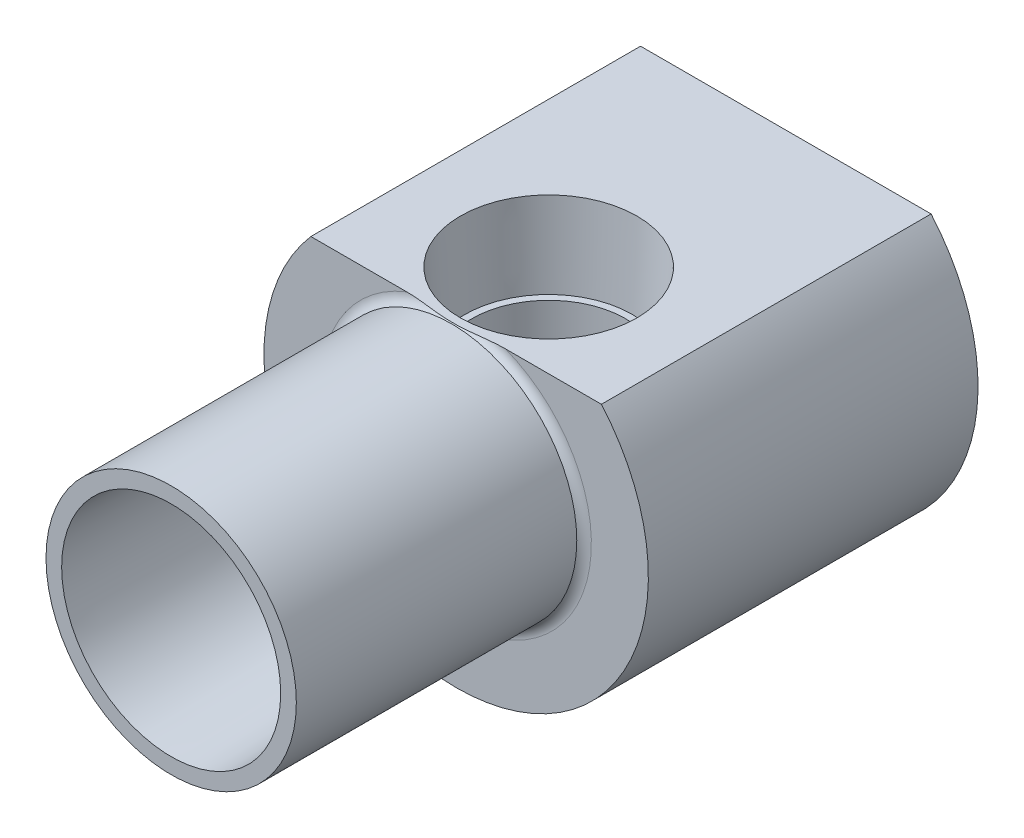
ISO-10303-21;
HEADER;
FILE_DESCRIPTION(('STEP AP214'),'2;1');
FILE_NAME('part.step','',(''),(''),'','','');
FILE_SCHEMA(('AUTOMOTIVE_DESIGN { 1 0 10303 214 1 1 1 1 }'));
ENDSEC;
DATA;
#1=APPLICATION_CONTEXT('core data for automotive mechanical design processes');
#2=APPLICATION_PROTOCOL_DEFINITION('international standard','automotive_design',2000,#1);
#3=PRODUCT_CONTEXT('',#1,'mechanical');
#4=PRODUCT('Part','Part','',(#3));
#5=PRODUCT_RELATED_PRODUCT_CATEGORY('part','',(#4));
#6=PRODUCT_DEFINITION_FORMATION('','',#4);
#7=PRODUCT_DEFINITION_CONTEXT('part definition',#1,'design');
#8=PRODUCT_DEFINITION('design','',#6,#7);
#9=PRODUCT_DEFINITION_SHAPE('','',#8);
#10=(LENGTH_UNIT() NAMED_UNIT(*) SI_UNIT(.MILLI.,.METRE.));
#11=(NAMED_UNIT(*) PLANE_ANGLE_UNIT() SI_UNIT($,.RADIAN.));
#12=(NAMED_UNIT(*) SI_UNIT($,.STERADIAN.) SOLID_ANGLE_UNIT());
#13=UNCERTAINTY_MEASURE_WITH_UNIT(LENGTH_MEASURE(1.E-05),#10,'distance_accuracy_value','');
#14=(GEOMETRIC_REPRESENTATION_CONTEXT(3) GLOBAL_UNCERTAINTY_ASSIGNED_CONTEXT((#13)) GLOBAL_UNIT_ASSIGNED_CONTEXT((#10,
#11,#12)) REPRESENTATION_CONTEXT('',''));
#15=CARTESIAN_POINT('',(0.,0.,0.));
#16=DIRECTION('',(0.,0.,1.));
#17=DIRECTION('',(1.,0.,0.));
#18=AXIS2_PLACEMENT_3D('',#15,#16,#17);
#19=CARTESIAN_POINT('',(0.,0.,-10.2798215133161));
#20=DIRECTION('',(0.,0.,1.));
#21=DIRECTION('',(1.,0.,0.));
#22=AXIS2_PLACEMENT_3D('',#19,#20,#21);
#23=PLANE('',#22);
#24=CARTESIAN_POINT('',(0.,0.,-10.2798215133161));
#25=DIRECTION('',(0.,0.,1.));
#26=DIRECTION('',(1.,0.,0.));
#27=AXIS2_PLACEMENT_3D('',#24,#25,#26);
#28=CIRCLE('',#27,5.55625);
#29=CARTESIAN_POINT('',(-1.44082268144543,5.36618524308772,-10.2798215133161));
#30=VERTEX_POINT('',#29);
#31=CARTESIAN_POINT('',(1.44082268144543,5.36618524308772,-10.2798215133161));
#32=VERTEX_POINT('',#31);
#33=EDGE_CURVE('E202',#30,#32,#28,.T.);
#34=ORIENTED_EDGE('',*,*,#33,.F.);
#35=CARTESIAN_POINT('',(0.,0.231743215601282,-10.2798215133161));
#36=DIRECTION('',(0.,0.,1.));
#37=DIRECTION('',(0.,1.,0.));
#38=AXIS2_PLACEMENT_3D('',#35,#36,#37);
#39=ELLIPSE('',#38,5.3595579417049,5.02418796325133);
#40=CARTESIAN_POINT('',(-0.633143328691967,5.54857381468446,-10.2798215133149));
#41=VERTEX_POINT('',#40);
#42=EDGE_CURVE('E39',#41,#30,#39,.T.);
#43=ORIENTED_EDGE('',*,*,#42,.F.);
#44=CARTESIAN_POINT('',(-23.046207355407,20.6384342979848,-10.2798215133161));
#45=CARTESIAN_POINT('',(-22.5460257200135,20.2705252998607,-10.2798215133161));
#46=CARTESIAN_POINT('',(-22.0457662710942,19.9027220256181,-10.2798215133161));
#47=CARTESIAN_POINT('',(-21.0443081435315,19.1668447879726,-10.2798215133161));
#48=CARTESIAN_POINT('',(-20.5431091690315,18.7987712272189,-10.2798215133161));
#49=CARTESIAN_POINT('',(-19.530971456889,18.055990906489,-10.2798215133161));
#50=CARTESIAN_POINT('',(-19.0200280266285,17.6812905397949,-10.2798215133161));
#51=CARTESIAN_POINT('',(-17.9985784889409,16.9328879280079,-10.2798215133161));
#52=CARTESIAN_POINT('',(-17.4880728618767,16.5591850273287,-10.2798215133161));
#53=CARTESIAN_POINT('',(-16.3371190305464,15.7176343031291,-10.2798215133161));
#54=CARTESIAN_POINT('',(-15.6965528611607,15.2499477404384,-10.2798215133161));
#55=CARTESIAN_POINT('',(-14.4143119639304,14.3156957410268,-10.2798215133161));
#56=CARTESIAN_POINT('',(-13.7726369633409,13.8491306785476,-10.2798215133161));
#57=CARTESIAN_POINT('',(-12.4833294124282,12.9145366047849,-10.2798215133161));
#58=CARTESIAN_POINT('',(-11.8356871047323,12.4465210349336,-10.2798215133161));
#59=CARTESIAN_POINT('',(-10.5390226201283,11.5140896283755,-10.2798215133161));
#60=CARTESIAN_POINT('',(-9.89000311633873,11.049670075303,-10.2798215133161));
#61=CARTESIAN_POINT('',(-8.60457068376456,10.1374634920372,-10.2798215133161));
#62=CARTESIAN_POINT('',(-7.96824753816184,9.68955068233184,-10.2798215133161));
#63=CARTESIAN_POINT('',(-7.00729220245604,9.02374639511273,-10.2798215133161));
#64=CARTESIAN_POINT('',(-6.68512358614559,8.80230458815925,-10.2798215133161));
#65=CARTESIAN_POINT('',(-6.0384763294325,8.36311677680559,-10.2798215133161));
#66=CARTESIAN_POINT('',(-5.71399878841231,8.14536916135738,-10.2798215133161));
#67=CARTESIAN_POINT('',(-5.06679249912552,7.71904099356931,-10.2798215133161));
#68=CARTESIAN_POINT('',(-4.74412464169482,7.51036816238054,-10.2798215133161));
#69=CARTESIAN_POINT('',(-4.09259845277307,7.10144120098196,-10.2798215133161));
#70=CARTESIAN_POINT('',(-3.76373015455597,6.90120266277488,-10.2798215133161));
#71=CARTESIAN_POINT('',(-3.26474854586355,6.61378997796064,-10.2798215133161));
#72=CARTESIAN_POINT('',(-3.09817382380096,6.52050200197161,-10.2798215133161));
#73=CARTESIAN_POINT('',(-2.7619895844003,6.33959428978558,-10.2798215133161));
#74=CARTESIAN_POINT('',(-2.59238073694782,6.25197332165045,-10.2798215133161));
#75=CARTESIAN_POINT('',(-2.24971099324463,6.08501986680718,-10.2798215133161));
#76=CARTESIAN_POINT('',(-2.07666165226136,6.0056638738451,-10.2798215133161));
#77=CARTESIAN_POINT('',(-1.72570706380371,5.85865056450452,-10.2798215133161));
#78=CARTESIAN_POINT('',(-1.54780705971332,5.79098115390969,-10.2798215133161));
#79=CARTESIAN_POINT('',(-1.30837027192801,5.71255347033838,-10.2798215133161));
#80=CARTESIAN_POINT('',(-1.2493049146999,5.69420118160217,-10.2798215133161));
#81=CARTESIAN_POINT('',(-1.13056070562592,5.65951068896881,-10.2798215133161));
#82=CARTESIAN_POINT('',(-1.07088165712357,5.64317315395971,-10.2798215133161));
#83=CARTESIAN_POINT('',(-0.95100494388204,5.61275726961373,-10.2798215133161));
#84=CARTESIAN_POINT('',(-0.890807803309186,5.59867686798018,-10.2798215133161));
#85=CARTESIAN_POINT('',(-0.769891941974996,5.57298020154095,-10.2798215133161));
#86=CARTESIAN_POINT('',(-0.70917321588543,5.56136396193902,-10.2798215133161));
#87=CARTESIAN_POINT('',(-0.529611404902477,5.53109226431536,-10.2798215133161));
#88=CARTESIAN_POINT('',(-0.410105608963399,5.51616925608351,-10.2798215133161));
#89=CARTESIAN_POINT('',(-0.170124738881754,5.49767023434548,-10.2798215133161));
#90=CARTESIAN_POINT('',(-0.0496490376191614,5.49410227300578,-10.2798215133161));
#91=CARTESIAN_POINT('',(0.193091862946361,5.49868698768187,-10.2798215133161));
#92=CARTESIAN_POINT('',(0.315353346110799,5.50703640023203,-10.2798215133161));
#93=CARTESIAN_POINT('',(0.558506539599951,5.53506744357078,-10.2798215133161));
#94=CARTESIAN_POINT('',(0.679398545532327,5.55474657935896,-10.2798215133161));
#95=CARTESIAN_POINT('',(0.920511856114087,5.60420984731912,-10.2798215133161));
#96=CARTESIAN_POINT('',(1.04070924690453,5.63410817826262,-10.2798215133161));
#97=CARTESIAN_POINT('',(1.27872364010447,5.70213932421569,-10.2798215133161));
#98=CARTESIAN_POINT('',(1.39654030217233,5.74027330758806,-10.2798215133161));
#99=CARTESIAN_POINT('',(1.70053124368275,5.84812935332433,-10.2798215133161));
#100=CARTESIAN_POINT('',(1.88486752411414,5.92299036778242,-10.2798215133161));
#101=CARTESIAN_POINT('',(2.24858746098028,6.08401515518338,-10.2798215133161));
#102=CARTESIAN_POINT('',(2.42796650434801,6.17018905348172,-10.2798215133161));
#103=CARTESIAN_POINT('',(2.78323895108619,6.35041323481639,-10.2798215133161));
#104=CARTESIAN_POINT('',(2.95912274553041,6.44448228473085,-10.2798215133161));
#105=CARTESIAN_POINT('',(3.30791517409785,6.63800661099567,-10.2798215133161));
#106=CARTESIAN_POINT('',(3.48082326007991,6.73746286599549,-10.2798215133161));
#107=CARTESIAN_POINT('',(4.00003764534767,7.04376748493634,-10.2798215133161));
#108=CARTESIAN_POINT('',(4.34288845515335,7.25645350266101,-10.2798215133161));
#109=CARTESIAN_POINT('',(4.8527751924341,7.58156407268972,-10.2798215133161));
#110=CARTESIAN_POINT('',(5.02185822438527,7.69084850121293,-10.2798215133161));
#111=CARTESIAN_POINT('',(5.35892582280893,7.91109435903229,-10.2798215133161));
#112=CARTESIAN_POINT('',(5.52691042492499,8.0220557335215,-10.2798215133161));
#113=CARTESIAN_POINT('',(6.06971277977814,8.38358919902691,-10.2798215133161));
#114=CARTESIAN_POINT('',(6.44281464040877,8.63673166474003,-10.2798215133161));
#115=CARTESIAN_POINT('',(7.18631180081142,9.14696866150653,-10.2798215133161));
#116=CARTESIAN_POINT('',(7.55670700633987,9.40406332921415,-10.2798215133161));
#117=CARTESIAN_POINT('',(8.66528585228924,10.1792197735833,-10.2798215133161));
#118=CARTESIAN_POINT('',(9.40079152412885,10.7011056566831,-10.2798215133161));
#119=CARTESIAN_POINT('',(10.8690419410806,11.7504086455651,-10.2798215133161));
#120=CARTESIAN_POINT('',(11.6017827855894,12.2778311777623,-10.2798215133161));
#121=CARTESIAN_POINT('',(13.0651205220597,13.3355548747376,-10.2798215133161));
#122=CARTESIAN_POINT('',(13.7957175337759,13.8658558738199,-10.2798215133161));
#123=CARTESIAN_POINT('',(15.2014025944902,14.8888136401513,-10.2798215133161));
#124=CARTESIAN_POINT('',(15.8765843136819,15.38134187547,-10.2798215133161));
#125=CARTESIAN_POINT('',(17.2261848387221,16.3674685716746,-10.2798215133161));
#126=CARTESIAN_POINT('',(17.9006036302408,16.8610670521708,-10.2798215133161));
#127=CARTESIAN_POINT('',(19.2479934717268,17.8483575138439,-10.2798215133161));
#128=CARTESIAN_POINT('',(19.9209652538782,18.3420484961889,-10.2798215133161));
#129=CARTESIAN_POINT('',(21.2664801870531,19.3299861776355,-10.2798215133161));
#130=CARTESIAN_POINT('',(21.9390233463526,19.8242328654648,-10.2798215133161));
#131=CARTESIAN_POINT('',(22.6114257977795,20.3186706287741,-10.2798215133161));
#132=B_SPLINE_CURVE_WITH_KNOTS('',3,(#44,#45,#46,#47,#48,#49,#50,#51,#52,#53,#54,#55,#56,#57,
#58,#59,#60,#61,#62,#63,#64,#65,#66,#67,#68,#69,#70,#71,#72,#73,#74,#75,#76,#77,#78,#79,#80,#81,
#82,#83,#84,#85,#86,#87,#88,#89,#90,#91,#92,#93,#94,#95,#96,#97,#98,#99,#100,#101,#102,#103,
#104,#105,#106,#107,#108,#109,#110,#111,#112,#113,#114,#115,#116,#117,#118,#119,#120,#121,#122,
#123,#124,#125,#126,#127,#128,#129,#130,#131),.UNSPECIFIED.,.F.,.F.,(4,2,2,2,2,2,2,2,2,2,2,2,2,
2,2,2,2,2,2,2,2,2,2,2,2,2,2,2,2,2,2,2,2,2,2,2,2,2,2,2,2,2,2,4),(0.,1.86275292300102,
3.72825732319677,5.62909167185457,7.52709793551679,9.9064877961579,12.2865843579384,
14.6837244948,17.0779193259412,19.4123425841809,20.5851298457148,21.7573917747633,
22.9101283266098,24.0649098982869,24.6375927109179,25.2101506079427,25.7810328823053,
26.3513207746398,26.5368444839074,26.7224296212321,26.9078450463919,27.0932623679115,
27.4540347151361,27.8150628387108,28.1821203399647,28.5490970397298,28.9203165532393,
29.2915887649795,29.8878329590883,30.4846144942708,31.0828571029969,31.6812087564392,
32.8913041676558,33.4952842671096,34.0992446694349,35.4518160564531,36.8044343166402,
39.5099289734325,42.2183833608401,44.9266834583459,47.4338900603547,49.9411429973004,
52.4450588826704,54.9489248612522),.UNSPECIFIED.);
#133=CARTESIAN_POINT('',(-0.521512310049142,5.53172115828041,-10.2798215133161));
#134=VERTEX_POINT('',#133);
#135=EDGE_CURVE('E271',#134,#41,#132,.F.);
#136=ORIENTED_EDGE('',*,*,#135,.F.);
#137=CARTESIAN_POINT('',(0.521512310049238,5.53172115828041,-10.2798215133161));
#138=VERTEX_POINT('',#137);
#139=EDGE_CURVE('E206',#138,#134,#28,.T.);
#140=ORIENTED_EDGE('',*,*,#139,.F.);
#141=CARTESIAN_POINT('',(0.633143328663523,5.54857381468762,-10.2798215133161));
#142=VERTEX_POINT('',#141);
#143=EDGE_CURVE('E24',#142,#138,#132,.F.);
#144=ORIENTED_EDGE('',*,*,#143,.F.);
#145=EDGE_CURVE('E203',#32,#142,#39,.T.);
#146=ORIENTED_EDGE('',*,*,#145,.F.);
#147=EDGE_LOOP('',(#34,#43,#136,#140,#144,#146));
#148=FACE_BOUND('',#147,.T.);
#149=CARTESIAN_POINT('',(0.,0.,-10.2798215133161));
#150=DIRECTION('',(0.,0.,1.));
#151=DIRECTION('',(1.,0.,0.));
#152=AXIS2_PLACEMENT_3D('',#149,#150,#151);
#153=CIRCLE('',#152,5.96274025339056);
#154=CARTESIAN_POINT('',(5.96274025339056,0.,-10.2798215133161));
#155=VERTEX_POINT('',#154);
#156=EDGE_CURVE('E10',#155,#155,#153,.F.);
#157=ORIENTED_EDGE('',*,*,#156,.F.);
#158=EDGE_LOOP('',(#157));
#159=FACE_BOUND('',#158,.T.);
#160=ADVANCED_FACE('F16',(#148,#159),#23,.T.);
#161=CARTESIAN_POINT('',(0.,0.,-17.018));
#162=DIRECTION('',(0.,0.,-1.));
#163=DIRECTION('',(-1.,0.,0.));
#164=AXIS2_PLACEMENT_3D('',#161,#162,#163);
#165=TOROIDAL_SURFACE('',#164,7.6835,0.762);
#166=CARTESIAN_POINT('',(0.,7.15157737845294,-17.5636210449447));
#167=CARTESIAN_POINT('',(0.127127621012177,7.15157737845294,-17.5636202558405));
#168=CARTESIAN_POINT('',(0.254254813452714,7.15157737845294,-17.566993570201));
#169=CARTESIAN_POINT('',(0.508332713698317,7.15157737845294,-17.579690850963));
#170=CARTESIAN_POINT('',(0.635283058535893,7.15157737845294,-17.5890215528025));
#171=CARTESIAN_POINT('',(0.889309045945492,7.15157737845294,-17.6117271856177));
#172=CARTESIAN_POINT('',(1.01638315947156,7.15157737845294,-17.6251181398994));
#173=CARTESIAN_POINT('',(1.27029244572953,7.15157737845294,-17.653572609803));
#174=CARTESIAN_POINT('',(1.39712768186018,7.15157737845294,-17.6686355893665));
#175=CARTESIAN_POINT('',(1.65056504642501,7.15157737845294,-17.6981150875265));
#176=CARTESIAN_POINT('',(1.77716699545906,7.15157737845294,-17.7125330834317));
#177=CARTESIAN_POINT('',(2.03071053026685,7.15157737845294,-17.7386078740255));
#178=CARTESIAN_POINT('',(2.15765220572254,7.15157737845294,-17.7502638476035));
#179=CARTESIAN_POINT('',(2.41173215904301,7.15157737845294,-17.7686014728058));
#180=CARTESIAN_POINT('',(2.53886988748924,7.15157737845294,-17.7752902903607));
#181=CARTESIAN_POINT('',(2.79330778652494,7.15157737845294,-17.78127517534));
#182=CARTESIAN_POINT('',(2.92060778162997,7.15157737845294,-17.7805764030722));
#183=CARTESIAN_POINT('',(3.11175181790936,7.15157737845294,-17.7716159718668));
#184=CARTESIAN_POINT('',(3.17577795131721,7.15157737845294,-17.7672740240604));
#185=CARTESIAN_POINT('',(3.3035256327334,7.15157737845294,-17.7553876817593));
#186=CARTESIAN_POINT('',(3.36724726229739,7.15157737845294,-17.747844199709));
#187=CARTESIAN_POINT('',(3.49394936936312,7.15157737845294,-17.7289499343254));
#188=CARTESIAN_POINT('',(3.55693145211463,7.15157737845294,-17.7176101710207));
#189=CARTESIAN_POINT('',(3.68186952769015,7.15157737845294,-17.6903216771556));
#190=CARTESIAN_POINT('',(3.74382626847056,7.15157737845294,-17.6743764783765));
#191=CARTESIAN_POINT('',(3.85770524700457,7.15157737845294,-17.6393711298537));
#192=CARTESIAN_POINT('',(3.90984533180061,7.15157737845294,-17.621030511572));
#193=CARTESIAN_POINT('',(4.01219951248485,7.15157737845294,-17.5791399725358));
#194=CARTESIAN_POINT('',(4.06240844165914,7.15157737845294,-17.5555770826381));
#195=CARTESIAN_POINT('',(4.16007183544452,7.15157737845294,-17.5017183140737));
#196=CARTESIAN_POINT('',(4.2074778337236,7.15157737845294,-17.4713327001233));
#197=CARTESIAN_POINT('',(4.29603836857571,7.15157737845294,-17.4025304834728));
#198=CARTESIAN_POINT('',(4.33722703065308,7.15157737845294,-17.3641606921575));
#199=CARTESIAN_POINT('',(4.39035142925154,7.15157737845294,-17.3002540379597));
#200=CARTESIAN_POINT('',(4.40646864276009,7.15157737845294,-17.2782023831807));
#201=CARTESIAN_POINT('',(4.43527330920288,7.15157737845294,-17.2319316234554));
#202=CARTESIAN_POINT('',(4.4479622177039,7.15157737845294,-17.2077134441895));
#203=CARTESIAN_POINT('',(4.46909955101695,7.15157737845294,-17.1571473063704));
#204=CARTESIAN_POINT('',(4.47750104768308,7.15157737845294,-17.1307792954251));
#205=CARTESIAN_POINT('',(4.48899151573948,7.15157737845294,-17.0769103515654));
#206=CARTESIAN_POINT('',(4.49208717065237,7.15157737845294,-17.0494108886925));
#207=CARTESIAN_POINT('',(4.49258744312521,7.15157737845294,-16.9977926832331));
#208=CARTESIAN_POINT('',(4.49065116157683,7.15157737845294,-16.9736782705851));
#209=CARTESIAN_POINT('',(4.48262933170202,7.15157737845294,-16.9261525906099));
#210=CARTESIAN_POINT('',(4.47654239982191,7.15157737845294,-16.9027415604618));
#211=CARTESIAN_POINT('',(4.46092126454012,7.15157737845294,-16.8577895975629));
#212=CARTESIAN_POINT('',(4.45147841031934,7.15157737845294,-16.8362162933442));
#213=CARTESIAN_POINT('',(4.42971706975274,7.15157737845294,-16.7945910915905));
#214=CARTESIAN_POINT('',(4.41739763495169,7.15157737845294,-16.77453969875));
#215=CARTESIAN_POINT('',(4.38149746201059,7.15157737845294,-16.723282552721));
#216=CARTESIAN_POINT('',(4.3558705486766,7.15157737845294,-16.693510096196));
#217=CARTESIAN_POINT('',(4.30031570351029,7.15157737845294,-16.6382895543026));
#218=CARTESIAN_POINT('',(4.27037497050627,7.15157737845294,-16.6128548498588));
#219=CARTESIAN_POINT('',(4.1859290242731,7.15157737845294,-16.5495570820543));
#220=CARTESIAN_POINT('',(4.12876294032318,7.15157737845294,-16.5152736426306));
#221=CARTESIAN_POINT('',(4.01015335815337,7.15157737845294,-16.4552773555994));
#222=CARTESIAN_POINT('',(3.94869889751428,7.15157737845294,-16.4295875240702));
#223=CARTESIAN_POINT('',(3.82329511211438,7.15157737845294,-16.3849182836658));
#224=CARTESIAN_POINT('',(3.75934062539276,7.15157737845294,-16.3659536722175));
#225=CARTESIAN_POINT('',(3.63004227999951,7.15157737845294,-16.3334440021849));
#226=CARTESIAN_POINT('',(3.56469706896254,7.15157737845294,-16.3199044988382));
#227=CARTESIAN_POINT('',(3.43320609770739,7.15157737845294,-16.2972483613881));
#228=CARTESIAN_POINT('',(3.36705969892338,7.15157737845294,-16.2881355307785));
#229=CARTESIAN_POINT('',(3.23440415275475,7.15157737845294,-16.2735790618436));
#230=CARTESIAN_POINT('',(3.16789515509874,7.15157737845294,-16.2681340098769));
#231=CARTESIAN_POINT('',(3.02615333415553,7.15157737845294,-16.2597867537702));
#232=CARTESIAN_POINT('',(2.95089691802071,7.15157737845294,-16.2573008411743));
#233=CARTESIAN_POINT('',(2.8003401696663,7.15157737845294,-16.2554911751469));
#234=CARTESIAN_POINT('',(2.7250398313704,7.15157737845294,-16.2561681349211));
#235=CARTESIAN_POINT('',(2.49915684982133,7.15157737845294,-16.262028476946));
#236=CARTESIAN_POINT('',(2.34867963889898,7.15157737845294,-16.2710449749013));
#237=CARTESIAN_POINT('',(2.04813604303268,7.15157737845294,-16.2952875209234));
#238=CARTESIAN_POINT('',(1.89807027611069,7.15157737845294,-16.3105202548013));
#239=CARTESIAN_POINT('',(1.59818715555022,7.15157737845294,-16.3436436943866));
#240=CARTESIAN_POINT('',(1.44836992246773,7.15157737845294,-16.3615354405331));
#241=CARTESIAN_POINT('',(1.17325772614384,7.15157737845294,-16.3934482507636));
#242=CARTESIAN_POINT('',(1.04798108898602,7.15157737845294,-16.407622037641));
#243=CARTESIAN_POINT('',(0.797116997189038,7.15157737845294,-16.432998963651));
#244=CARTESIAN_POINT('',(0.671529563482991,7.15157737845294,-16.4442022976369));
#245=CARTESIAN_POINT('',(0.420237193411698,7.15157737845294,-16.461485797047));
#246=CARTESIAN_POINT('',(0.294533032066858,7.15157737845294,-16.4675764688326));
#247=CARTESIAN_POINT('',(0.0429851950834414,7.15157737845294,-16.473313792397));
#248=CARTESIAN_POINT('',(-0.0828584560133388,7.15157737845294,-16.4729614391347));
#249=CARTESIAN_POINT('',(-0.334448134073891,7.15157737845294,-16.4658958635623));
#250=CARTESIAN_POINT('',(-0.460194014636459,7.15157737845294,-16.4591778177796));
#251=CARTESIAN_POINT('',(-0.711337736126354,7.15157737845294,-16.4408522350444));
#252=CARTESIAN_POINT('',(-0.836735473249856,7.15157737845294,-16.4292433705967));
#253=CARTESIAN_POINT('',(-1.08748905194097,7.15157737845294,-16.4032752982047));
#254=CARTESIAN_POINT('',(-1.21284427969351,7.15157737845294,-16.3889104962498));
#255=CARTESIAN_POINT('',(-1.46348211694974,7.15157737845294,-16.3597058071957));
#256=CARTESIAN_POINT('',(-1.58876473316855,7.15157737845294,-16.3448659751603));
#257=CARTESIAN_POINT('',(-1.83845966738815,7.15157737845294,-16.3169678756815));
#258=CARTESIAN_POINT('',(-1.96287034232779,7.15157737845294,-16.3038955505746));
#259=CARTESIAN_POINT('',(-2.21201411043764,7.15157737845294,-16.2814205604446));
#260=CARTESIAN_POINT('',(-2.33674711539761,7.15157737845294,-16.2720169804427));
#261=CARTESIAN_POINT('',(-2.58640031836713,7.15157737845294,-16.2590441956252));
#262=CARTESIAN_POINT('',(-2.71132014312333,7.15157737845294,-16.2554683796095));
#263=CARTESIAN_POINT('',(-2.96112038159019,7.15157737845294,-16.256661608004));
#264=CARTESIAN_POINT('',(-3.08600075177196,7.15157737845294,-16.2614242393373));
#265=CARTESIAN_POINT('',(-3.27324246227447,7.15157737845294,-16.2774314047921));
#266=CARTESIAN_POINT('',(-3.33597566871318,7.15157737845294,-16.2843047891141));
#267=CARTESIAN_POINT('',(-3.46093404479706,7.15157737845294,-16.301648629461));
#268=CARTESIAN_POINT('',(-3.5231594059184,7.15157737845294,-16.3121176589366));
#269=CARTESIAN_POINT('',(-3.64652628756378,7.15157737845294,-16.3373417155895));
#270=CARTESIAN_POINT('',(-3.70767082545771,7.15157737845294,-16.3520817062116));
#271=CARTESIAN_POINT('',(-3.8284280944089,7.15157737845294,-16.3867984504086));
#272=CARTESIAN_POINT('',(-3.88804262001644,7.15157737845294,-16.4067687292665));
#273=CARTESIAN_POINT('',(-3.98549638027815,7.15157737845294,-16.4455818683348));
#274=CARTESIAN_POINT('',(-4.02404554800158,7.15157737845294,-16.4626330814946));
#275=CARTESIAN_POINT('',(-4.09949076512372,7.15157737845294,-16.5001991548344));
#276=CARTESIAN_POINT('',(-4.1363853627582,7.15157737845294,-16.5207169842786));
#277=CARTESIAN_POINT('',(-4.20793109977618,7.15157737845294,-16.5659773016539));
#278=CARTESIAN_POINT('',(-4.24256249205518,7.15157737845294,-16.5907514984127));
#279=CARTESIAN_POINT('',(-4.30787600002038,7.15157737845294,-16.6450842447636));
#280=CARTESIAN_POINT('',(-4.33856577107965,7.15157737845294,-16.6746332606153));
#281=CARTESIAN_POINT('',(-4.38444572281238,7.15157737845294,-16.7280775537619));
#282=CARTESIAN_POINT('',(-4.40135962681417,7.15157737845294,-16.7504835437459));
#283=CARTESIAN_POINT('',(-4.43165752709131,7.15157737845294,-16.797595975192));
#284=CARTESIAN_POINT('',(-4.44504340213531,7.15157737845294,-16.8223011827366));
#285=CARTESIAN_POINT('',(-4.46741930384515,7.15157737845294,-16.8740173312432));
#286=CARTESIAN_POINT('',(-4.47635597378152,7.15157737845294,-16.9010519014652));
#287=CARTESIAN_POINT('',(-4.48863421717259,7.15157737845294,-16.9563610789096));
#288=CARTESIAN_POINT('',(-4.4919840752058,7.15157737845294,-16.9846337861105));
#289=CARTESIAN_POINT('',(-4.49264602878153,7.15157737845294,-17.0371334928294));
#290=CARTESIAN_POINT('',(-4.49076240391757,7.15157737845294,-17.0613533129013));
#291=CARTESIAN_POINT('',(-4.48280701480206,7.15157737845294,-17.1090932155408));
#292=CARTESIAN_POINT('',(-4.47673380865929,7.15157737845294,-17.132613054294));
#293=CARTESIAN_POINT('',(-4.46114097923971,7.15157737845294,-17.1776679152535));
#294=CARTESIAN_POINT('',(-4.45172990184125,7.15157737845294,-17.1992412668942));
#295=CARTESIAN_POINT('',(-4.43003065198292,7.15157737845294,-17.240868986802));
#296=CARTESIAN_POINT('',(-4.41774168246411,7.15157737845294,-17.2609229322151));
#297=CARTESIAN_POINT('',(-4.38194241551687,7.15157737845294,-17.3121572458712));
#298=CARTESIAN_POINT('',(-4.35639045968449,7.15157737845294,-17.3419108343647));
#299=CARTESIAN_POINT('',(-4.30098352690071,7.15157737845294,-17.3971079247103));
#300=CARTESIAN_POINT('',(-4.27111526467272,7.15157737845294,-17.4225375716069));
#301=CARTESIAN_POINT('',(-4.18688578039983,7.15157737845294,-17.4858134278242));
#302=CARTESIAN_POINT('',(-4.12986602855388,7.15157737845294,-17.5200911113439));
#303=CARTESIAN_POINT('',(-4.01156954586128,7.15157737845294,-17.5800819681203));
#304=CARTESIAN_POINT('',(-3.9502834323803,7.15157737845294,-17.6057754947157));
#305=CARTESIAN_POINT('',(-3.8252756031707,7.15157737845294,-17.6504467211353));
#306=CARTESIAN_POINT('',(-3.76155102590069,7.15157737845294,-17.6694162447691));
#307=CARTESIAN_POINT('',(-3.63270405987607,7.15157737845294,-17.701958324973));
#308=CARTESIAN_POINT('',(-3.56758016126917,7.15157737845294,-17.7155247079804));
#309=CARTESIAN_POINT('',(-3.43645021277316,7.15157737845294,-17.7382633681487));
#310=CARTESIAN_POINT('',(-3.37044261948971,7.15157737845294,-17.7474265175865));
#311=CARTESIAN_POINT('',(-3.23809736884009,7.15157737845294,-17.7620788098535));
#312=CARTESIAN_POINT('',(-3.17176006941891,7.15157737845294,-17.7675713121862));
#313=CARTESIAN_POINT('',(-2.97604116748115,7.15157737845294,-17.7792894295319));
#314=CARTESIAN_POINT('',(-2.84641018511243,7.15157737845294,-17.7812894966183));
#315=CARTESIAN_POINT('',(-2.58724459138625,7.15157737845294,-17.7772582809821));
#316=CARTESIAN_POINT('',(-2.45771016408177,7.15157737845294,-17.7712199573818));
#317=CARTESIAN_POINT('',(-2.06871938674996,7.15157737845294,-17.7449491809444));
#318=CARTESIAN_POINT('',(-1.80988277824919,7.15157737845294,-17.7165448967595));
#319=CARTESIAN_POINT('',(-1.4222034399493,7.15157737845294,-17.6715953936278));
#320=CARTESIAN_POINT('',(-1.29314210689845,7.15157737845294,-17.6562305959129));
#321=CARTESIAN_POINT('',(-1.03480406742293,7.15157737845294,-17.6271001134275));
#322=CARTESIAN_POINT('',(-0.905527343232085,7.15157737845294,-17.6133345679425));
#323=CARTESIAN_POINT('',(-0.647025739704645,7.15157737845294,-17.5899309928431));
#324=CARTESIAN_POINT('',(-0.517802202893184,7.15157737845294,-17.580278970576));
#325=CARTESIAN_POINT('',(-0.259052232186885,7.15157737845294,-17.5671252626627));
#326=CARTESIAN_POINT('',(-0.129525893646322,7.15157737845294,-17.5636218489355));
#327=CARTESIAN_POINT('',(0.,7.15157737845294,-17.5636210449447));
#328=B_SPLINE_CURVE_WITH_KNOTS('',3,(#166,#167,#168,#169,#170,#171,#172,#173,#174,#175,#176,
#177,#178,#179,#180,#181,#182,#183,#184,#185,#186,#187,#188,#189,#190,#191,#192,#193,#194,#195,
#196,#197,#198,#199,#200,#201,#202,#203,#204,#205,#206,#207,#208,#209,#210,#211,#212,#213,#214,
#215,#216,#217,#218,#219,#220,#221,#222,#223,#224,#225,#226,#227,#228,#229,#230,#231,#232,#233,
#234,#235,#236,#237,#238,#239,#240,#241,#242,#243,#244,#245,#246,#247,#248,#249,#250,#251,#252,
#253,#254,#255,#256,#257,#258,#259,#260,#261,#262,#263,#264,#265,#266,#267,#268,#269,#270,#271,
#272,#273,#274,#275,#276,#277,#278,#279,#280,#281,#282,#283,#284,#285,#286,#287,#288,#289,#290,
#291,#292,#293,#294,#295,#296,#297,#298,#299,#300,#301,#302,#303,#304,#305,#306,#307,#308,#309,
#310,#311,#312,#313,#314,#315,#316,#317,#318,#319,#320,#321,#322,#323,#324,#325,#326,#327),
.UNSPECIFIED.,.T.,.F.,(4,2,2,2,2,2,2,2,2,2,2,2,2,2,2,2,2,2,2,2,2,2,2,2,2,2,2,2,2,2,2,2,2,2,2,2,
2,2,2,2,2,2,2,2,2,2,2,2,2,2,2,2,2,2,2,2,2,2,2,2,2,2,2,2,2,2,2,2,2,2,2,2,2,2,2,2,2,2,2,2,4),(0.,
0.381345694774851,0.76312330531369,1.14642761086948,1.52960938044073,1.91186312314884,
2.29423036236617,2.67604489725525,3.05759274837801,3.25004952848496,3.44245149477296,
3.63429972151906,3.82600121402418,3.9916062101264,4.15762717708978,4.32597494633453,
4.49336217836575,4.57506450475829,4.65673208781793,4.73927536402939,4.82171458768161,
4.89391441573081,4.96613832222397,5.03653040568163,5.10694573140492,5.22411325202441,
5.3416359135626,5.54048572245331,5.73986392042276,5.93967812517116,6.13969641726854,
6.33988626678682,6.53999891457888,6.76580702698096,6.99166606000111,7.44364590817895,
7.8961131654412,8.34875793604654,8.72697650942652,9.10517026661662,9.48258493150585,
9.85994131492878,10.2375838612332,10.6153289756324,10.9938491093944,11.3723255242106,
11.7475882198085,12.1227572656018,12.4975004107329,12.8719554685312,13.0612009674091,
13.2503714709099,13.4388838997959,13.627164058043,13.7534849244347,13.8799145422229,
14.0073304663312,14.1344950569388,14.2184616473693,14.3023834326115,14.3872887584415,
14.4720680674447,14.5445671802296,14.617091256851,14.6874455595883,14.7578193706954,
14.8747986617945,14.9921459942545,15.1906123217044,15.389529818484,15.588688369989,
15.7880738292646,15.9878708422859,16.1874847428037,16.576010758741,16.9648773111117,
17.7456198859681,18.135572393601,18.5255588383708,18.9142078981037,19.3027477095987),.UNSPECIFIED.);
#329=CARTESIAN_POINT('',(-2.80911253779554,7.15157737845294,-17.78));
#330=VERTEX_POINT('',#329);
#331=CARTESIAN_POINT('',(2.80911253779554,7.15157737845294,-17.78));
#332=VERTEX_POINT('',#331);
#333=EDGE_CURVE('E420',#330,#332,#328,.T.);
#334=ORIENTED_EDGE('',*,*,#333,.F.);
#335=CARTESIAN_POINT('',(0.,0.,-17.78));
#336=DIRECTION('',(0.,0.,-1.));
#337=DIRECTION('',(-1.,0.,0.));
#338=AXIS2_PLACEMENT_3D('',#335,#336,#337);
#339=CIRCLE('',#338,7.6835);
#340=EDGE_CURVE('E413',#332,#330,#339,.T.);
#341=ORIENTED_EDGE('',*,*,#340,.F.);
#342=EDGE_LOOP('',(#334,#341));
#343=FACE_BOUND('',#342,.T.);
#344=CARTESIAN_POINT('',(0.,0.,-17.5220156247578));
#345=DIRECTION('',(0.,0.,1.));
#346=DIRECTION('',(1.,0.,0.));
#347=AXIS2_PLACEMENT_3D('',#344,#345,#346);
#348=CIRCLE('',#347,7.112);
#349=CARTESIAN_POINT('',(7.112,0.,-17.5220156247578));
#350=VERTEX_POINT('',#349);
#351=EDGE_CURVE('E198',#350,#350,#348,.T.);
#352=ORIENTED_EDGE('',*,*,#351,.F.);
#353=EDGE_LOOP('',(#352));
#354=FACE_BOUND('',#353,.T.);
#355=ADVANCED_FACE('F332',(#343,#354),#165,.F.);
#356=CARTESIAN_POINT('',(0.,0.,-75.1971669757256));
#357=DIRECTION('',(0.,0.,-1.));
#358=DIRECTION('',(-1.,0.,0.));
#359=AXIS2_PLACEMENT_3D('',#356,#357,#358);
#360=CYLINDRICAL_SURFACE('',#359,5.55625);
#361=CARTESIAN_POINT('',(0.20776055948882,5.5523643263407,-10.2872));
#362=CARTESIAN_POINT('',(0.355702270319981,5.54684862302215,-10.2852277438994));
#363=CARTESIAN_POINT('',(0.503386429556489,5.53538234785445,-10.2811307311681));
#364=CARTESIAN_POINT('',(0.79717417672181,5.50074914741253,-10.2687483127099));
#365=CARTESIAN_POINT('',(0.943278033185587,5.47758424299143,-10.2604636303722));
#366=CARTESIAN_POINT('',(1.23261523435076,5.41980740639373,-10.2397860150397));
#367=CARTESIAN_POINT('',(1.37585352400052,5.38521739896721,-10.2274009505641));
#368=CARTESIAN_POINT('',(1.65876215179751,5.3049072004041,-10.1986184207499));
#369=CARTESIAN_POINT('',(1.79843242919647,5.25918681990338,-10.1822208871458));
#370=CARTESIAN_POINT('',(2.07360140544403,5.15690699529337,-10.1454954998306));
#371=CARTESIAN_POINT('',(2.20908917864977,5.10032156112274,-10.1251582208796));
#372=CARTESIAN_POINT('',(2.47471113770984,4.9768641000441,-10.0807246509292));
#373=CARTESIAN_POINT('',(2.60484334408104,4.90998831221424,-10.0566269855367));
#374=CARTESIAN_POINT('',(2.85884459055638,4.76656946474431,-10.0048649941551));
#375=CARTESIAN_POINT('',(2.98271626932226,4.69003052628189,-9.97720218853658));
#376=CARTESIAN_POINT('',(3.22357400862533,4.52786604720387,-9.91848618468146));
#377=CARTESIAN_POINT('',(3.34055758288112,4.44223725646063,-9.88743177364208));
#378=CARTESIAN_POINT('',(3.57092315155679,4.25943591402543,-9.82100333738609));
#379=CARTESIAN_POINT('',(3.68403469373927,4.16196371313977,-9.78551596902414));
#380=CARTESIAN_POINT('',(3.90151960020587,3.95881348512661,-9.71138540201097));
#381=CARTESIAN_POINT('',(4.00589248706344,3.85313501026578,-9.67274203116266));
#382=CARTESIAN_POINT('',(4.20547426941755,3.63426188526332,-9.59251055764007));
#383=CARTESIAN_POINT('',(4.30067261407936,3.52105882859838,-9.55091915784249));
#384=CARTESIAN_POINT('',(4.4812945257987,3.28810480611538,-9.46510683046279));
#385=CARTESIAN_POINT('',(4.56672060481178,3.1683555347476,-9.42088658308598));
#386=CARTESIAN_POINT('',(4.73442294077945,2.91247876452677,-9.32613771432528));
#387=CARTESIAN_POINT('',(4.81578536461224,2.77583107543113,-9.2753944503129));
#388=CARTESIAN_POINT('',(4.96619310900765,2.49679193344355,-9.17144989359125));
#389=CARTESIAN_POINT('',(5.03523653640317,2.35439960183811,-9.11824822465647));
#390=CARTESIAN_POINT('',(5.16061424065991,2.06513468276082,-9.00981949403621));
#391=CARTESIAN_POINT('',(5.21696571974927,1.91826846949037,-8.95459529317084));
#392=CARTESIAN_POINT('',(5.31686925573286,1.62093722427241,-8.84242410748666));
#393=CARTESIAN_POINT('',(5.36042500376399,1.4704732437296,-8.78547762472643));
#394=CARTESIAN_POINT('',(5.39749413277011,1.31870055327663,-8.72783933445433));
#395=B_SPLINE_CURVE_WITH_KNOTS('',3,(#361,#362,#363,#364,#365,#366,#367,#368,#369,#370,#371,
#372,#373,#374,#375,#376,#377,#378,#379,#380,#381,#382,#383,#384,#385,#386,#387,#388,#389,#390,
#391,#392,#393,#394),.UNSPECIFIED.,.F.,.F.,(4,2,2,2,2,2,2,2,2,2,2,2,2,2,2,2,4),(0.,
0.44402902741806,0.887981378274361,1.33108668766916,1.77419953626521,2.21838585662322,
2.66273490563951,3.10689508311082,3.55121461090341,4.01112643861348,4.47106337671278,
4.93152308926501,5.39186417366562,5.8920810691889,6.39237477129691,6.89198625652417,
7.39145347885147),.UNSPECIFIED.);
#396=CARTESIAN_POINT('',(0.222213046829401,5.55180469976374,-10.287));
#397=VERTEX_POINT('',#396);
#398=EDGE_CURVE('E346',#397,#138,#395,.T.);
#399=ORIENTED_EDGE('',*,*,#398,.T.);
#400=ORIENTED_EDGE('',*,*,#139,.T.);
#401=CARTESIAN_POINT('',(-5.39749413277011,1.31870055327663,-8.72783933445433));
#402=CARTESIAN_POINT('',(-5.35890103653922,1.47671891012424,-8.78784975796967));
#403=CARTESIAN_POINT('',(-5.31327443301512,1.63331886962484,-8.84711004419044));
#404=CARTESIAN_POINT('',(-5.20816520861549,1.94256760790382,-8.96374580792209));
#405=CARTESIAN_POINT('',(-5.14867904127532,2.09521536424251,-9.02112079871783));
#406=CARTESIAN_POINT('',(-5.01593038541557,2.39570565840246,-9.1336985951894));
#407=CARTESIAN_POINT('',(-4.94263676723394,2.54353643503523,-9.18889614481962));
#408=CARTESIAN_POINT('',(-4.78271250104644,2.83282272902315,-9.29657622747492));
#409=CARTESIAN_POINT('',(-4.69608315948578,2.97427886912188,-9.34905902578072));
#410=CARTESIAN_POINT('',(-4.51063310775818,3.24858489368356,-9.45053421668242));
#411=CARTESIAN_POINT('',(-4.41190975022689,3.38149186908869,-9.49955004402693));
#412=CARTESIAN_POINT('',(-4.20231733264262,3.63867536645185,-9.59414314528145));
#413=CARTESIAN_POINT('',(-4.09144869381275,3.76295218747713,-9.63972053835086));
#414=CARTESIAN_POINT('',(-3.85838005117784,4.00157479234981,-9.72701748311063));
#415=CARTESIAN_POINT('',(-3.73619312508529,4.11593174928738,-9.7687413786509));
#416=CARTESIAN_POINT('',(-3.48120721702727,4.33373028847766,-9.84803105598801));
#417=CARTESIAN_POINT('',(-3.34840914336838,4.43717280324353,-9.88559719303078));
#418=CARTESIAN_POINT('',(-3.08143608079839,4.62620675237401,-9.95411374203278));
#419=CARTESIAN_POINT('',(-2.94782287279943,4.71249720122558,-9.98532599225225));
#420=CARTESIAN_POINT('',(-2.67300099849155,4.87363837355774,-10.0435209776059));
#421=CARTESIAN_POINT('',(-2.53179296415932,4.94849004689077,-10.070504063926));
#422=CARTESIAN_POINT('',(-2.24285888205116,5.08596838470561,-10.1199985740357));
#423=CARTESIAN_POINT('',(-2.09513566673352,5.14860029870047,-10.142511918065));
#424=CARTESIAN_POINT('',(-1.79432791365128,5.26099764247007,-10.1828719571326));
#425=CARTESIAN_POINT('',(-1.64124483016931,5.31076653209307,-10.2007199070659));
#426=CARTESIAN_POINT('',(-1.27830417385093,5.41149144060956,-10.2368148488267));
#427=CARTESIAN_POINT('',(-1.06674483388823,5.45716347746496,-10.2531578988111));
#428=CARTESIAN_POINT('',(-0.746380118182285,5.5069534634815,-10.2709666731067));
#429=CARTESIAN_POINT('',(-0.63911535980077,5.5204293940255,-10.2757849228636));
#430=CARTESIAN_POINT('',(-0.423876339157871,5.54111231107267,-10.2831786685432));
#431=CARTESIAN_POINT('',(-0.315901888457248,5.54831755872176,-10.2857535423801));
#432=CARTESIAN_POINT('',(-0.207760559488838,5.5523643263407,-10.2872));
#433=B_SPLINE_CURVE_WITH_KNOTS('',3,(#401,#402,#403,#404,#405,#406,#407,#408,#409,#410,#411,
#412,#413,#414,#415,#416,#417,#418,#419,#420,#421,#422,#423,#424,#425,#426,#427,#428,#429,#430,
#431,#432),.UNSPECIFIED.,.F.,.F.,(4,2,2,2,2,2,2,2,2,2,2,2,2,2,2,4),(0.,0.520010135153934,
1.04015347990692,1.5614838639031,2.08276320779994,2.60009261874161,3.11740409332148,
3.63412512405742,4.15080197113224,4.63644560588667,5.12204889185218,5.60744310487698,
6.09270662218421,6.7419807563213,7.06645222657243,7.39101364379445),.UNSPECIFIED.);
#434=CARTESIAN_POINT('',(-0.222213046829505,5.55180469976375,-10.287));
#435=VERTEX_POINT('',#434);
#436=EDGE_CURVE('E339',#134,#435,#433,.T.);
#437=ORIENTED_EDGE('',*,*,#436,.T.);
#438=CARTESIAN_POINT('',(0.,0.,-10.287));
#439=DIRECTION('',(0.,0.,-1.));
#440=DIRECTION('',(-1.,0.,0.));
#441=AXIS2_PLACEMENT_3D('',#438,#439,#440);
#442=CIRCLE('',#441,5.55625);
#443=EDGE_CURVE('E411',#435,#397,#442,.T.);
#444=ORIENTED_EDGE('',*,*,#443,.T.);
#445=EDGE_LOOP('',(#399,#400,#437,#444));
#446=FACE_BOUND('',#445,.T.);
#447=ADVANCED_FACE('F328',(#446),#360,.F.);
#448=CARTESIAN_POINT('',(-0.225583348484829,5.55166877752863,-10.3363507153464));
#449=CARTESIAN_POINT('',(-0.320231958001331,5.54782261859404,-10.3351889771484));
#450=CARTESIAN_POINT('',(-0.414752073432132,5.54155690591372,-10.3332980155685));
#451=CARTESIAN_POINT('',(-0.603312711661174,5.52421014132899,-10.3280522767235));
#452=CARTESIAN_POINT('',(-0.697353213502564,5.51312888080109,-10.3246974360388));
#453=CARTESIAN_POINT('',(-0.978594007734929,5.47267164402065,-10.3124212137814));
#454=CARTESIAN_POINT('',(-1.1647258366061,5.4360898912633,-10.3012904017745));
#455=CARTESIAN_POINT('',(-1.49482252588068,5.3535297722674,-10.2759456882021));
#456=CARTESIAN_POINT('',(-1.63973393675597,5.31092477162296,-10.2628032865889));
#457=CARTESIAN_POINT('',(-1.92531225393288,5.21419289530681,-10.2326942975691));
#458=CARTESIAN_POINT('',(-2.06597800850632,5.16006292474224,-10.2157266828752));
#459=CARTESIAN_POINT('',(-2.34204258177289,5.04077090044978,-10.1779066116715));
#460=CARTESIAN_POINT('',(-2.477440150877,4.975606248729,-10.1570532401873));
#461=CARTESIAN_POINT('',(-2.74206184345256,4.83481959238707,-10.1113670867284));
#462=CARTESIAN_POINT('',(-2.8712831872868,4.7591929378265,-10.0865325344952));
#463=CARTESIAN_POINT('',(-3.1224674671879,4.59829654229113,-10.0327982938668));
#464=CARTESIAN_POINT('',(-3.24443853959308,4.51303793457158,-10.0039032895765));
#465=CARTESIAN_POINT('',(-3.48043320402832,4.33364258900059,-9.94186877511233));
#466=CARTESIAN_POINT('',(-3.59446008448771,4.23950956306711,-9.90873103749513));
#467=CARTESIAN_POINT('',(-3.81396472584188,4.04317708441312,-9.83794809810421));
#468=CARTESIAN_POINT('',(-3.91943750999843,3.94097300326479,-9.80030030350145));
#469=CARTESIAN_POINT('',(-4.12112325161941,3.72955754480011,-9.72019979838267));
#470=CARTESIAN_POINT('',(-4.21733638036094,3.62034629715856,-9.67774717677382));
#471=CARTESIAN_POINT('',(-4.40139827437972,3.39428656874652,-9.58691555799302));
#472=CARTESIAN_POINT('',(-4.48909244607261,3.27734526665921,-9.53845415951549));
#473=CARTESIAN_POINT('',(-4.65392424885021,3.03873753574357,-9.43558393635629));
#474=CARTESIAN_POINT('',(-4.73106218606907,2.91707124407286,-9.38117528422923));
#475=CARTESIAN_POINT('',(-4.87437334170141,2.67070690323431,-9.26577281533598));
#476=CARTESIAN_POINT('',(-4.94056172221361,2.54601332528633,-9.20478830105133));
#477=CARTESIAN_POINT('',(-5.06193347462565,2.29524127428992,-9.07532395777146));
#478=CARTESIAN_POINT('',(-5.11712192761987,2.16916346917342,-9.0068476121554));
#479=CARTESIAN_POINT('',(-5.21546694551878,1.92049091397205,-8.86302745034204));
#480=CARTESIAN_POINT('',(-5.25886951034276,1.7978823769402,-8.78787618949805));
#481=CARTESIAN_POINT('',(-5.33557623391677,1.55553015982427,-8.62847013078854));
#482=CARTESIAN_POINT('',(-5.36888668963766,1.43578473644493,-8.54422105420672));
#483=CARTESIAN_POINT('',(-5.42135867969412,1.221028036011,-8.38053609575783));
#484=CARTESIAN_POINT('',(-5.44195038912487,1.12520748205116,-8.30261798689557));
#485=CARTESIAN_POINT('',(-5.47719387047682,0.938755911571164,-8.13949789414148));
#486=CARTESIAN_POINT('',(-5.49184442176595,0.848125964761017,-8.05429441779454));
#487=CARTESIAN_POINT('',(-5.51600575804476,0.673350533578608,-7.87643285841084));
#488=CARTESIAN_POINT('',(-5.52550553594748,0.589219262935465,-7.78375929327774));
#489=CARTESIAN_POINT('',(-5.54025943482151,0.428868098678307,-7.59152205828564));
#490=CARTESIAN_POINT('',(-5.5455145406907,0.352646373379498,-7.49195999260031));
#491=CARTESIAN_POINT('',(-5.55245163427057,0.21554987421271,-7.29627939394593));
#492=CARTESIAN_POINT('',(-5.55442132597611,0.153906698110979,-7.2007067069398));
#493=CARTESIAN_POINT('',(-5.55642407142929,0.0378505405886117,-7.00521450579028));
#494=CARTESIAN_POINT('',(-5.55645645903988,-0.0165599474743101,-6.90529350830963));
#495=CARTESIAN_POINT('',(-5.55522538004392,-0.118284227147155,-6.70195618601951));
#496=CARTESIAN_POINT('',(-5.55396211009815,-0.165599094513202,-6.59854039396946));
#497=CARTESIAN_POINT('',(-5.55062951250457,-0.253568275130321,-6.38904607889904));
#498=CARTESIAN_POINT('',(-5.54856103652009,-0.294229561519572,-6.28297047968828));
#499=CARTESIAN_POINT('',(-5.54633260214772,-0.33182635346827,-6.17587820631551));
#500=B_SPLINE_CURVE_WITH_KNOTS('',3,(#448,#449,#450,#451,#452,#453,#454,#455,#456,#457,#458,
#459,#460,#461,#462,#463,#464,#465,#466,#467,#468,#469,#470,#471,#472,#473,#474,#475,#476,#477,
#478,#479,#480,#481,#482,#483,#484,#485,#486,#487,#488,#489,#490,#491,#492,#493,#494,#495,#496,
#497,#498,#499),.UNSPECIFIED.,.F.,.F.,(4,2,2,2,2,2,2,2,2,2,2,2,2,2,2,2,2,2,2,2,2,2,2,2,2,4),(0.,
0.284125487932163,0.568263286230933,1.1370998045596,1.5914419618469,2.04590628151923,
2.50047774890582,2.95525190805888,3.40950568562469,3.86357029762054,4.31789721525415,
4.7722157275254,5.23364937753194,5.69506964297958,6.15584552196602,6.61640806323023,
7.06645225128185,7.51621505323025,7.89141060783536,8.26668320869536,8.64275462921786,
9.01873876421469,9.3596323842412,9.70064321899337,10.0416023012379,10.3822017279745),.UNSPECIFIED.);
#501=CARTESIAN_POINT('',(-1.3508451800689,5.38953906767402,-10.287));
#502=VERTEX_POINT('',#501);
#503=EDGE_CURVE('E292',#502,#30,#500,.T.);
#504=ORIENTED_EDGE('',*,*,#503,.T.);
#505=ORIENTED_EDGE('',*,*,#33,.T.);
#506=CARTESIAN_POINT('',(5.54633260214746,-0.331826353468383,-6.17587820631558));
#507=CARTESIAN_POINT('',(5.54778107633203,-0.307569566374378,-6.24493285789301));
#508=CARTESIAN_POINT('',(5.54915053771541,-0.282060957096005,-6.31354676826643));
#509=CARTESIAN_POINT('',(5.55162046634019,-0.228369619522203,-6.44974994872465));
#510=CARTESIAN_POINT('',(5.55272084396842,-0.200186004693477,-6.51733887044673));
#511=CARTESIAN_POINT('',(5.55545358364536,-0.111287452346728,-6.71852164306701));
#512=CARTESIAN_POINT('',(5.5565116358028,-0.0463094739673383,-6.85028597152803));
#513=CARTESIAN_POINT('',(5.55588099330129,0.0951638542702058,-7.10619548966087));
#514=CARTESIAN_POINT('',(5.55421302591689,0.171568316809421,-7.23039079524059));
#515=CARTESIAN_POINT('',(5.54668695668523,0.336049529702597,-7.47050926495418));
#516=CARTESIAN_POINT('',(5.54083371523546,0.424112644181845,-7.58644185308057));
#517=CARTESIAN_POINT('',(5.52653135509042,0.577008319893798,-7.76867496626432));
#518=CARTESIAN_POINT('',(5.51978753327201,0.638718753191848,-7.83775726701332));
#519=CARTESIAN_POINT('',(5.50357609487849,0.765955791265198,-7.97196216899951));
#520=CARTESIAN_POINT('',(5.49410852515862,0.831482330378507,-8.03708483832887));
#521=CARTESIAN_POINT('',(5.46107994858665,1.03293129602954,-8.22636243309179));
#522=CARTESIAN_POINT('',(5.43288566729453,1.17381599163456,-8.34453606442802));
#523=CARTESIAN_POINT('',(5.36954597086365,1.43311371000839,-8.54219753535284));
#524=CARTESIAN_POINT('',(5.33710958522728,1.55002119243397,-8.62459447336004));
#525=CARTESIAN_POINT('',(5.26262831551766,1.78662572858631,-8.78070724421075));
#526=CARTESIAN_POINT('',(5.220579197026,1.90632399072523,-8.85441922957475));
#527=CARTESIAN_POINT('',(5.12645739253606,2.14663667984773,-8.99418020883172));
#528=CARTESIAN_POINT('',(5.0743618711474,2.26725258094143,-9.06021118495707));
#529=CARTESIAN_POINT('',(4.96013862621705,2.50731085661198,-9.18530971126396));
#530=CARTESIAN_POINT('',(4.89801199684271,2.62675335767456,-9.24437801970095));
#531=CARTESIAN_POINT('',(4.76413402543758,2.8623805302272,-9.35608413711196));
#532=CARTESIAN_POINT('',(4.69242769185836,2.97857753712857,-9.40874994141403));
#533=CARTESIAN_POINT('',(4.5394212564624,3.20693951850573,-9.5086004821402));
#534=CARTESIAN_POINT('',(4.45812104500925,3.31910444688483,-9.55578515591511));
#535=CARTESIAN_POINT('',(4.28634037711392,3.53815817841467,-9.64515651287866));
#536=CARTESIAN_POINT('',(4.19586539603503,3.64505007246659,-9.68734614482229));
#537=CARTESIAN_POINT('',(4.00611378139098,3.85262915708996,-9.76717560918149));
#538=CARTESIAN_POINT('',(3.90683317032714,3.95331350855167,-9.80481336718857));
#539=CARTESIAN_POINT('',(3.69438665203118,4.15280599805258,-9.87776849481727));
#540=CARTESIAN_POINT('',(3.58075820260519,4.25120993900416,-9.91284616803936));
#541=CARTESIAN_POINT('',(3.34514118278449,4.4389899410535,-9.97851188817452));
#542=CARTESIAN_POINT('',(3.22315614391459,4.52836977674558,-10.0091018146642));
#543=CARTESIAN_POINT('',(2.9716846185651,4.69722528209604,-10.0659883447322));
#544=CARTESIAN_POINT('',(2.84220313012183,4.77670744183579,-10.0922877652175));
#545=CARTESIAN_POINT('',(2.57661842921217,4.92504647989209,-10.1407492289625));
#546=CARTESIAN_POINT('',(2.44051758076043,4.99390711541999,-10.1629127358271));
#547=CARTESIAN_POINT('',(2.1485903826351,5.12676376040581,-10.2052468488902));
#548=CARTESIAN_POINT('',(1.99215835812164,5.18957027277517,-10.2249915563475));
#549=CARTESIAN_POINT('',(1.6739196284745,5.30078379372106,-10.2596748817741));
#550=CARTESIAN_POINT('',(1.51211782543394,5.34920355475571,-10.274617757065));
#551=CARTESIAN_POINT('',(1.16497108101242,5.43602912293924,-10.3012715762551));
#552=CARTESIAN_POINT('',(0.979106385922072,5.47257119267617,-10.3123905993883));
#553=CARTESIAN_POINT('',(0.698005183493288,5.51304842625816,-10.324673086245));
#554=CARTESIAN_POINT('',(0.603837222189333,5.52415495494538,-10.3280355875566));
#555=CARTESIAN_POINT('',(0.415016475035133,5.54153948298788,-10.3332927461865));
#556=CARTESIAN_POINT('',(0.320363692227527,5.54781751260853,-10.3351874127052));
#557=CARTESIAN_POINT('',(0.225583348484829,5.55166877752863,-10.3363507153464));
#558=B_SPLINE_CURVE_WITH_KNOTS('',3,(#506,#507,#508,#509,#510,#511,#512,#513,#514,#515,#516,
#517,#518,#519,#520,#521,#522,#523,#524,#525,#526,#527,#528,#529,#530,#531,#532,#533,#534,#535,
#536,#537,#538,#539,#540,#541,#542,#543,#544,#545,#546,#547,#548,#549,#550,#551,#552,#553,#554,
#555,#556,#557),.UNSPECIFIED.,.F.,.F.,(4,2,2,2,2,2,2,2,2,2,2,2,2,2,2,2,2,2,2,2,2,2,2,2,2,4),(0.,
0.219594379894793,0.439261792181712,0.879373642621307,1.31615464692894,1.75242923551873,
2.03086455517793,2.30929508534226,2.86572890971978,3.30513632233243,3.74473766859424,
4.18535026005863,4.62591482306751,5.06447785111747,5.50304589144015,5.94135372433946,
6.37986055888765,6.84236431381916,7.30467380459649,7.76667853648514,8.22851946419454,
8.73690101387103,9.24483057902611,9.81288268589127,10.0974078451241,10.3819312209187),.UNSPECIFIED.);
#559=CARTESIAN_POINT('',(1.3508451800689,5.38953906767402,-10.287));
#560=VERTEX_POINT('',#559);
#561=EDGE_CURVE('E282',#32,#560,#558,.T.);
#562=ORIENTED_EDGE('',*,*,#561,.T.);
#563=EDGE_CURVE('E405',#560,#502,#442,.T.);
#564=ORIENTED_EDGE('',*,*,#563,.T.);
#565=EDGE_LOOP('',(#504,#505,#562,#564));
#566=FACE_BOUND('',#565,.T.);
#567=ADVANCED_FACE('F277',(#566),#360,.F.);
#568=CARTESIAN_POINT('',(0.,0.510853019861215,-8.44917062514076));
#569=DIRECTION('',(0.,0.341537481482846,0.939868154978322));
#570=DIRECTION('',(0.,-0.939868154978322,0.341537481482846));
#571=AXIS2_PLACEMENT_3D('',#568,#569,#570);
#572=CONICAL_SURFACE('',#571,5.39729413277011,0.195720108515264);
#573=CARTESIAN_POINT('',(-0.0258266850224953,-7.0931683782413,-23.0400916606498));
#574=CARTESIAN_POINT('',(-0.0263921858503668,-7.09292284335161,-23.0385413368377));
#575=CARTESIAN_POINT('',(-0.0268225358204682,-7.09267145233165,-23.0369433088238));
#576=CARTESIAN_POINT('',(-0.0274071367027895,-7.09216445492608,-23.0336985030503));
#577=CARTESIAN_POINT('',(-0.0275614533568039,-7.09190884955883,-23.0320517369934));
#578=CARTESIAN_POINT('',(-0.027588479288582,-7.09140052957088,-23.0287536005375));
#579=CARTESIAN_POINT('',(-0.0274608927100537,-7.09114781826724,-23.0271022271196));
#580=CARTESIAN_POINT('',(-0.0269255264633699,-7.09065270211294,-23.0238442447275));
#581=CARTESIAN_POINT('',(-0.0265178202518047,-7.09041029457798,-23.0222376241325));
#582=CARTESIAN_POINT('',(-0.0254339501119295,-7.08994390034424,-23.019125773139));
#583=CARTESIAN_POINT('',(-0.024759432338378,-7.08971981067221,-23.0176199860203));
#584=CARTESIAN_POINT('',(-0.0231576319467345,-7.08929463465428,-23.0147454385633));
#585=CARTESIAN_POINT('',(-0.0222303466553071,-7.0890935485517,-23.0133766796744));
#586=CARTESIAN_POINT('',(-0.02017471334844,-7.08872503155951,-23.010854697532));
#587=CARTESIAN_POINT('',(-0.019052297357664,-7.08855685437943,-23.009696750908));
#588=CARTESIAN_POINT('',(-0.0166211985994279,-7.08825240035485,-23.0075913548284));
#589=CARTESIAN_POINT('',(-0.0153125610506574,-7.0881161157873,-23.0066438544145));
#590=CARTESIAN_POINT('',(-0.0125919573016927,-7.08788312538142,-23.005018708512));
#591=CARTESIAN_POINT('',(-0.011184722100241,-7.0877852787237,-23.0043333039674));
#592=CARTESIAN_POINT('',(-0.00827188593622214,-7.0876256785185,-23.0032130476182));
#593=CARTESIAN_POINT('',(-0.00676629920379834,-7.08756391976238,-23.002778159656));
#594=CARTESIAN_POINT('',(-0.00374074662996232,-7.08747927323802,-23.0021816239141));
#595=CARTESIAN_POINT('',(-0.00222211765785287,-7.08745543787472,-23.002013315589));
#596=CARTESIAN_POINT('',(0.000821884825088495,-7.08744427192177,-23.0019345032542));
#597=CARTESIAN_POINT('',(0.00234725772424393,-7.08745693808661,-23.002023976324));
#598=CARTESIAN_POINT('',(0.00534457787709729,-7.08751810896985,-23.0024553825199));
#599=CARTESIAN_POINT('',(0.00681691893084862,-7.08756623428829,-23.0027946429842));
#600=CARTESIAN_POINT('',(0.00968372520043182,-7.08769664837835,-23.0037115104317));
#601=CARTESIAN_POINT('',(0.0110781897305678,-7.08777893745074,-23.004289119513));
#602=CARTESIAN_POINT('',(0.0137601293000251,-7.08797623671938,-23.0056688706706));
#603=CARTESIAN_POINT('',(0.0150468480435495,-7.08809145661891,-23.0064724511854));
#604=CARTESIAN_POINT('',(0.017469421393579,-7.08835149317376,-23.0082776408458));
#605=CARTESIAN_POINT('',(0.0186052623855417,-7.08849631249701,-23.0092792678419));
#606=CARTESIAN_POINT('',(0.0207207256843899,-7.08881540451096,-23.0114744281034));
#607=CARTESIAN_POINT('',(0.0216964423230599,-7.08899024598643,-23.0126716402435));
#608=CARTESIAN_POINT('',(0.023437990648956,-7.08936271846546,-23.0152067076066));
#609=CARTESIAN_POINT('',(0.0242038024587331,-7.08956035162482,-23.0165445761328));
#610=CARTESIAN_POINT('',(0.0255288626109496,-7.08997990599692,-23.0193664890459));
#611=CARTESIAN_POINT('',(0.0260810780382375,-7.09020238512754,-23.0208537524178));
#612=CARTESIAN_POINT('',(0.0269335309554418,-7.09066080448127,-23.023897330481));
#613=CARTESIAN_POINT('',(0.0272336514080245,-7.09089675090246,-23.0254536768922));
#614=CARTESIAN_POINT('',(0.0275815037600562,-7.09138326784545,-23.0286408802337));
#615=CARTESIAN_POINT('',(0.0276213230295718,-7.09163406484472,-23.030272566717));
#616=CARTESIAN_POINT('',(0.0274275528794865,-7.09213629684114,-23.0335175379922));
#617=CARTESIAN_POINT('',(0.0271943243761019,-7.09238773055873,-23.0351308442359));
#618=CARTESIAN_POINT('',(0.0265635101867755,-7.09281557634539,-23.0378584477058));
#619=CARTESIAN_POINT('',(0.026229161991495,-7.09299351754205,-23.0389874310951));
#620=CARTESIAN_POINT('',(0.0258266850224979,-7.0931683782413,-23.0400916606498));
#621=B_SPLINE_CURVE_WITH_KNOTS('',3,(#573,#574,#575,#576,#577,#578,#579,#580,#581,#582,#583,
#584,#585,#586,#587,#588,#589,#590,#591,#592,#593,#594,#595,#596,#597,#598,#599,#600,#601,#602,
#603,#604,#605,#606,#607,#608,#609,#610,#611,#612,#613,#614,#615,#616,#617,#618,#619,#620),
.UNSPECIFIED.,.F.,.F.,(4,2,2,2,2,2,2,2,2,2,2,2,2,2,2,2,2,2,2,2,2,2,2,4),(0.,0.00499845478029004,
0.0099957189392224,0.0149982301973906,0.019999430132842,0.0249702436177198,0.0299411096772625,
0.034781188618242,0.0396200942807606,0.0443019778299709,0.0489831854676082,0.0535454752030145,
0.0581073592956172,0.0626211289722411,0.0671349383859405,0.0716781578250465,0.0762217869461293,
0.0808635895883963,0.0855058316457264,0.0902900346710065,0.0950764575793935,0.100007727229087,
0.104932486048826,0.108496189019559),.UNSPECIFIED.);
#622=CARTESIAN_POINT('',(-0.0265394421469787,-7.09281541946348,-23.0378555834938));
#623=VERTEX_POINT('',#622);
#624=CARTESIAN_POINT('',(0.0265394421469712,-7.09281541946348,-23.0378555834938));
#625=VERTEX_POINT('',#624);
#626=EDGE_CURVE('E265',#623,#625,#621,.T.);
#627=ORIENTED_EDGE('',*,*,#626,.F.);
#628=CARTESIAN_POINT('',(0.,-5.05906939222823,-23.7768959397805));
#629=DIRECTION('',(0.,-0.341537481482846,-0.939868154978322));
#630=DIRECTION('',(0.,0.939868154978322,-0.341537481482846));
#631=AXIS2_PLACEMENT_3D('',#628,#629,#630);
#632=CIRCLE('',#631,2.1640258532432);
#633=CARTESIAN_POINT('',(-1.93769623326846,-5.96463672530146,-23.4478229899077));
#634=VERTEX_POINT('',#633);
#635=EDGE_CURVE('E358',#623,#634,#632,.T.);
#636=ORIENTED_EDGE('',*,*,#635,.T.);
#637=CARTESIAN_POINT('',(-2.80006093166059,-4.58744323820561,-19.6879693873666));
#638=CARTESIAN_POINT('',(-2.75666849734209,-4.66822944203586,-19.8341657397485));
#639=CARTESIAN_POINT('',(-2.7126002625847,-4.74862959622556,-19.9803770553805));
#640=CARTESIAN_POINT('',(-2.62325647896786,-4.90815280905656,-20.273231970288));
#641=CARTESIAN_POINT('',(-2.57798031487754,-4.98727518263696,-20.419875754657));
#642=CARTESIAN_POINT('',(-2.48431605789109,-5.14722934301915,-20.7205702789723));
#643=CARTESIAN_POINT('',(-2.43588035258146,-5.22797376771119,-20.8746529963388));
#644=CARTESIAN_POINT('',(-2.36298278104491,-5.34652373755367,-21.1069855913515));
#645=CARTESIAN_POINT('',(-2.33864603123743,-5.38560781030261,-21.1846212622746));
#646=CARTESIAN_POINT('',(-2.29009790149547,-5.46262362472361,-21.3404995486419));
#647=CARTESIAN_POINT('',(-2.26588651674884,-5.50055541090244,-21.418742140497));
#648=CARTESIAN_POINT('',(-2.21757536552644,-5.57535597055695,-21.5772084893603));
#649=CARTESIAN_POINT('',(-2.19348183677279,-5.61220261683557,-21.6574446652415));
#650=CARTESIAN_POINT('',(-2.14630236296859,-5.68357960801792,-21.8192853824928));
#651=CARTESIAN_POINT('',(-2.12321678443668,-5.71810911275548,-21.9008904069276));
#652=CARTESIAN_POINT('',(-2.07935920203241,-5.78313918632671,-22.0646189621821));
#653=CARTESIAN_POINT('',(-2.05855449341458,-5.8136983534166,-22.1467099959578));
#654=CARTESIAN_POINT('',(-2.02020714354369,-5.86971714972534,-22.3133867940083));
#655=CARTESIAN_POINT('',(-2.00266252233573,-5.89517987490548,-22.3979710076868));
#656=CARTESIAN_POINT('',(-1.97665166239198,-5.93275580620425,-22.5471345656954));
#657=CARTESIAN_POINT('',(-1.96701189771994,-5.94661839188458,-22.6110566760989));
#658=CARTESIAN_POINT('',(-1.95112567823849,-5.96918869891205,-22.7402024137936));
#659=CARTESIAN_POINT('',(-1.94487679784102,-5.97790010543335,-22.8054250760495));
#660=CARTESIAN_POINT('',(-1.93587977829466,-5.98959127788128,-22.9372701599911));
#661=CARTESIAN_POINT('',(-1.93316648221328,-5.99251414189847,-23.0039000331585));
#662=CARTESIAN_POINT('',(-1.93077380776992,-5.99259415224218,-23.1372258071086));
#663=CARTESIAN_POINT('',(-1.931096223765,-5.98974788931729,-23.2039217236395));
#664=CARTESIAN_POINT('',(-1.93443297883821,-5.97586740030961,-23.3773541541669));
#665=CARTESIAN_POINT('',(-1.93896808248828,-5.96090035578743,-23.483721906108));
#666=CARTESIAN_POINT('',(-1.94830531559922,-5.92244448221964,-23.6949689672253));
#667=CARTESIAN_POINT('',(-1.95310798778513,-5.89893775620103,-23.7998446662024));
#668=CARTESIAN_POINT('',(-1.95983047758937,-5.84686626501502,-24.0074046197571));
#669=CARTESIAN_POINT('',(-1.96177622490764,-5.81834965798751,-24.1101001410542));
#670=CARTESIAN_POINT('',(-1.96129473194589,-5.77317984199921,-24.2631850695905));
#671=CARTESIAN_POINT('',(-1.96057242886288,-5.75775773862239,-24.3139517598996));
#672=CARTESIAN_POINT('',(-1.9578677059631,-5.72625656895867,-24.4152474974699));
#673=CARTESIAN_POINT('',(-1.95588527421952,-5.71017749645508,-24.4657765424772));
#674=CARTESIAN_POINT('',(-1.95320496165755,-5.69384758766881,-24.5161918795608));
#675=B_SPLINE_CURVE_WITH_KNOTS('',3,(#637,#638,#639,#640,#641,#642,#643,#644,#645,#646,#647,
#648,#649,#650,#651,#652,#653,#654,#655,#656,#657,#658,#659,#660,#661,#662,#663,#664,#665,#666,
#667,#668,#669,#670,#671,#672,#673,#674),.UNSPECIFIED.,.F.,.F.,(4,2,2,2,2,2,2,2,2,2,2,2,2,2,2,2,
2,2,4),(0.,0.51773042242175,1.03572977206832,1.57742381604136,1.84820199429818,2.11896970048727,
2.39350395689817,2.66813722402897,2.93809351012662,3.20788530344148,3.40598066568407,
3.60393413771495,3.80382403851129,4.00383209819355,4.32572870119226,4.64830384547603,
4.96793277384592,5.1271035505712,5.28627583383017),.UNSPECIFIED.);
#676=CARTESIAN_POINT('',(-2.79995349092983,-4.58764323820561,-19.6883310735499));
#677=VERTEX_POINT('',#676);
#678=EDGE_CURVE('E250',#677,#634,#675,.T.);
#679=ORIENTED_EDGE('',*,*,#678,.F.);
#680=CARTESIAN_POINT('',(2.79988011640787,-4.58784323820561,-19.6882697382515));
#681=CARTESIAN_POINT('',(2.82557511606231,-4.51786426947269,-19.7097623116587));
#682=CARTESIAN_POINT('',(2.84871374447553,-4.44643419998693,-19.7295930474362));
#683=CARTESIAN_POINT('',(2.88989662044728,-4.30122853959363,-19.7654995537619));
#684=CARTESIAN_POINT('',(2.90794254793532,-4.22745373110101,-19.7815765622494));
#685=CARTESIAN_POINT('',(2.93884200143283,-4.07871012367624,-19.8094388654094));
#686=CARTESIAN_POINT('',(2.9517388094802,-4.00375703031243,-19.8212598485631));
#687=CARTESIAN_POINT('',(2.97268860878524,-3.85265000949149,-19.8406137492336));
#688=CARTESIAN_POINT('',(2.9807416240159,-3.77649608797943,-19.8481466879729));
#689=CARTESIAN_POINT('',(2.99789468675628,-3.54724472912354,-19.8642179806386));
#690=CARTESIAN_POINT('',(3.00004054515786,-3.39309891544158,-19.8662771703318));
#691=CARTESIAN_POINT('',(2.98777744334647,-3.08594090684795,-19.8547369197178));
#692=CARTESIAN_POINT('',(2.97333180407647,-2.93293197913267,-19.8411027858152));
#693=CARTESIAN_POINT('',(2.93494202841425,-2.66586302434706,-19.8058826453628));
#694=CARTESIAN_POINT('',(2.91397731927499,-2.55099895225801,-19.7868737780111));
#695=CARTESIAN_POINT('',(2.86414074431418,-2.32412001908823,-19.7428818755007));
#696=CARTESIAN_POINT('',(2.83526476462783,-2.21210667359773,-19.7178957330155));
#697=CARTESIAN_POINT('',(2.76998235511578,-1.99113153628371,-19.6632340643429));
#698=CARTESIAN_POINT('',(2.7335548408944,-1.88217927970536,-19.6335454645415));
#699=CARTESIAN_POINT('',(2.65345870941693,-1.66801766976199,-19.5707510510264));
#700=CARTESIAN_POINT('',(2.60979129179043,-1.56280769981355,-19.5376458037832));
#701=CARTESIAN_POINT('',(2.51361043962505,-1.35290932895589,-19.46791279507));
#702=CARTESIAN_POINT('',(2.46084378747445,-1.24836415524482,-19.4312029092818));
#703=CARTESIAN_POINT('',(2.3474204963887,-1.0441310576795,-19.3563712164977));
#704=CARTESIAN_POINT('',(2.28676208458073,-0.944444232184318,-19.3182490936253));
#705=CARTESIAN_POINT('',(2.15741169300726,-0.750912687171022,-19.2417640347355));
#706=CARTESIAN_POINT('',(2.08874122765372,-0.657053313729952,-19.2034019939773));
#707=CARTESIAN_POINT('',(1.94285984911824,-0.475956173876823,-19.1274630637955));
#708=CARTESIAN_POINT('',(1.86565405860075,-0.388714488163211,-19.0898857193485));
#709=CARTESIAN_POINT('',(1.68300911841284,-0.202620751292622,-19.0081105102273));
#710=CARTESIAN_POINT('',(1.57519301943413,-0.105836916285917,-18.9644240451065));
#711=CARTESIAN_POINT('',(1.34519442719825,0.071840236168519,-18.8828065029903));
#712=CARTESIAN_POINT('',(1.22303093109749,0.152754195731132,-18.8448679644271));
#713=CARTESIAN_POINT('',(0.988973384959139,0.28047254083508,-18.7842894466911));
#714=CARTESIAN_POINT('',(0.879436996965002,0.330826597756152,-18.7601151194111));
#715=CARTESIAN_POINT('',(0.652620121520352,0.414513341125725,-18.7196994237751));
#716=CARTESIAN_POINT('',(0.535346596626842,0.44786110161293,-18.703451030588));
#717=CARTESIAN_POINT('',(0.295004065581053,0.494914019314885,-18.6804722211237));
#718=CARTESIAN_POINT('',(0.171898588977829,0.508471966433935,-18.6738131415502));
#719=CARTESIAN_POINT('',(-0.0749099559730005,0.514053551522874,-18.6710755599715));
#720=CARTESIAN_POINT('',(-0.198612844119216,0.506083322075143,-18.6749940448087));
#721=CARTESIAN_POINT('',(-0.428021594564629,0.47160688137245,-18.6918608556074));
#722=CARTESIAN_POINT('',(-0.534160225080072,0.447339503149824,-18.7037180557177));
#723=CARTESIAN_POINT('',(-0.741012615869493,0.384429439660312,-18.7342514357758));
#724=CARTESIAN_POINT('',(-0.841724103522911,0.345780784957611,-18.7529304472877));
#725=CARTESIAN_POINT('',(-1.07636738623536,0.237861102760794,-18.8046102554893));
#726=CARTESIAN_POINT('',(-1.20690131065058,0.162533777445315,-18.840341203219));
#727=CARTESIAN_POINT('',(-1.45304290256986,-0.00655979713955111,-18.9190442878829));
#728=CARTESIAN_POINT('',(-1.56861480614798,-0.100368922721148,-18.9620332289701));
#729=CARTESIAN_POINT('',(-1.75617309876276,-0.274966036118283,-19.0400610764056));
#730=CARTESIAN_POINT('',(-1.83157464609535,-0.35257765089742,-19.0741719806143));
#731=CARTESIAN_POINT('',(-1.97482461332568,-0.514009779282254,-19.1435624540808));
#732=CARTESIAN_POINT('',(-2.04267177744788,-0.597831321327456,-19.1788422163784));
#733=CARTESIAN_POINT('',(-2.17127378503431,-0.77086194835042,-19.2497067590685));
#734=CARTESIAN_POINT('',(-2.23201531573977,-0.860080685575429,-19.2852919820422));
#735=CARTESIAN_POINT('',(-2.346570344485,-1.04305954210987,-19.3558423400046));
#736=CARTESIAN_POINT('',(-2.40038485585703,-1.13681899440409,-19.3908075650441));
#737=CARTESIAN_POINT('',(-2.50347688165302,-1.33249451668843,-19.4607441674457));
#738=CARTESIAN_POINT('',(-2.55246107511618,-1.43458794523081,-19.4956515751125));
#739=CARTESIAN_POINT('',(-2.6432471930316,-1.64276530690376,-19.5628733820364));
#740=CARTESIAN_POINT('',(-2.68504796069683,-1.74884987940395,-19.5951873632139));
#741=CARTESIAN_POINT('',(-2.76133381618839,-1.96452861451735,-19.656070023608));
#742=CARTESIAN_POINT('',(-2.79582788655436,-2.07411827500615,-19.6846432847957));
#743=CARTESIAN_POINT('',(-2.85725847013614,-2.29648666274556,-19.7368345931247));
#744=CARTESIAN_POINT('',(-2.88419758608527,-2.40926427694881,-19.7604543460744));
#745=CARTESIAN_POINT('',(-2.94096296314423,-2.69214704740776,-19.8111100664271));
#746=CARTESIAN_POINT('',(-2.96605804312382,-2.86398366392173,-19.8344190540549));
#747=CARTESIAN_POINT('',(-2.98856789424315,-3.1238265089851,-19.8554696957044));
#748=CARTESIAN_POINT('',(-2.99355215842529,-3.21068143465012,-19.8601704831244));
#749=CARTESIAN_POINT('',(-2.99812328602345,-3.3846443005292,-19.864480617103));
#750=CARTESIAN_POINT('',(-2.99771303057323,-3.47175208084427,-19.864092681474));
#751=CARTESIAN_POINT('',(-2.99106532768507,-3.64697215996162,-19.8578264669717));
#752=CARTESIAN_POINT('',(-2.98473368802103,-3.7350779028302,-19.8518594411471));
#753=CARTESIAN_POINT('',(-2.96576852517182,-3.910037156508,-19.8341983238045));
#754=CARTESIAN_POINT('',(-2.95313519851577,-3.99689070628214,-19.8225044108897));
#755=CARTESIAN_POINT('',(-2.92111241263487,-4.16960602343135,-19.7933787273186));
#756=CARTESIAN_POINT('',(-2.90163440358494,-4.25543875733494,-19.7758719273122));
#757=CARTESIAN_POINT('',(-2.85587745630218,-4.42411453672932,-19.7357518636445));
#758=CARTESIAN_POINT('',(-2.8295935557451,-4.50695535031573,-19.7131348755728));
#759=CARTESIAN_POINT('',(-2.79988011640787,-4.5878432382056,-19.6882697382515));
#760=B_SPLINE_CURVE_WITH_KNOTS('',3,(#680,#681,#682,#683,#684,#685,#686,#687,#688,#689,#690,
#691,#692,#693,#694,#695,#696,#697,#698,#699,#700,#701,#702,#703,#704,#705,#706,#707,#708,#709,
#710,#711,#712,#713,#714,#715,#716,#717,#718,#719,#720,#721,#722,#723,#724,#725,#726,#727,#728,
#729,#730,#731,#732,#733,#734,#735,#736,#737,#738,#739,#740,#741,#742,#743,#744,#745,#746,#747,
#748,#749,#750,#751,#752,#753,#754,#755,#756,#757,#758,#759),.UNSPECIFIED.,.F.,.F.,(4,2,2,2,2,2,
2,2,2,2,2,2,2,2,2,2,2,2,2,2,2,2,2,2,2,2,2,2,2,2,2,2,2,2,2,2,2,2,2,4),(0.,0.232681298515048,
0.46528575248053,0.695891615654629,0.926496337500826,1.38691117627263,1.84834582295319,
2.20277736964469,2.55739357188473,2.91301355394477,3.26857466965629,3.63640295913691,
4.0043140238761,4.37125895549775,4.73798484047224,5.19062535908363,5.642673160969,
6.01011005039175,6.3772206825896,6.74704845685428,7.11677089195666,7.44394277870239,
7.77125062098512,8.23333998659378,8.69651426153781,9.03645358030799,9.3764493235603,
9.71707219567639,10.057645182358,10.4128154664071,10.7680428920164,11.1228310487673,
11.4774968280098,12.0010100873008,12.2621296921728,12.5231098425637,12.7883133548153,
13.0535085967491,13.3222692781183,13.5912264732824),.UNSPECIFIED.);
#761=CARTESIAN_POINT('',(2.79995349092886,-4.58764323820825,-19.6883310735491));
#762=VERTEX_POINT('',#761);
#763=EDGE_CURVE('E299',#762,#677,#760,.T.);
#764=ORIENTED_EDGE('',*,*,#763,.F.);
#765=CARTESIAN_POINT('',(1.95320496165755,-5.69384758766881,-24.5161918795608));
#766=CARTESIAN_POINT('',(1.95612175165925,-5.71161297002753,-24.4613410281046));
#767=CARTESIAN_POINT('',(1.95821129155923,-5.72908290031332,-24.4063569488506));
#768=CARTESIAN_POINT('',(1.96091351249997,-5.76322867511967,-24.2961057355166));
#769=CARTESIAN_POINT('',(1.96152617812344,-5.7799045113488,-24.2408385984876));
#770=CARTESIAN_POINT('',(1.96141480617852,-5.82863784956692,-24.0738964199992));
#771=CARTESIAN_POINT('',(1.95870926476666,-5.8591738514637,-23.9617661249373));
#772=CARTESIAN_POINT('',(1.95060781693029,-5.91250458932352,-23.7403102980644));
#773=CARTESIAN_POINT('',(1.94531892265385,-5.9355510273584,-23.6310418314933));
#774=CARTESIAN_POINT('',(1.93601138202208,-5.9714259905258,-23.4109232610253));
#775=CARTESIAN_POINT('',(1.93198868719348,-5.98428728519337,-23.3000794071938));
#776=CARTESIAN_POINT('',(1.93094509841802,-5.99272283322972,-23.1262231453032));
#777=CARTESIAN_POINT('',(1.93163119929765,-5.99339789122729,-23.0634962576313));
#778=CARTESIAN_POINT('',(1.93592905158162,-5.98953478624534,-22.9383128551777));
#779=CARTESIAN_POINT('',(1.9395395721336,-5.98499881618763,-22.8758562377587));
#780=CARTESIAN_POINT('',(1.95001910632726,-5.9707583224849,-22.7512233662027));
#781=CARTESIAN_POINT('',(1.9569183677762,-5.96100571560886,-22.6890552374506));
#782=CARTESIAN_POINT('',(1.97370287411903,-5.93700410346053,-22.5660015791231));
#783=CARTESIAN_POINT('',(1.98358950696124,-5.92275300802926,-22.5051166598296));
#784=CARTESIAN_POINT('',(2.0063112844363,-5.88986887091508,-22.3816351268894));
#785=CARTESIAN_POINT('',(2.01927272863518,-5.87104694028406,-22.319113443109));
#786=CARTESIAN_POINT('',(2.0470946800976,-5.83046074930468,-22.1954499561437));
#787=CARTESIAN_POINT('',(2.06195617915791,-5.80869495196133,-22.1343088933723));
#788=CARTESIAN_POINT('',(2.10848877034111,-5.74011753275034,-21.9523402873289));
#789=CARTESIAN_POINT('',(2.14205489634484,-5.69010184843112,-21.8332243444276));
#790=CARTESIAN_POINT('',(2.21141893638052,-5.5849474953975,-21.5966796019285));
#791=CARTESIAN_POINT('',(2.2472340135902,-5.52976729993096,-21.4792751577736));
#792=CARTESIAN_POINT('',(2.31932800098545,-5.4165929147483,-21.2461667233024));
#793=CARTESIAN_POINT('',(2.35560630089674,-5.35860219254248,-21.1304608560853));
#794=CARTESIAN_POINT('',(2.42707571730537,-5.24220120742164,-20.9027533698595));
#795=CARTESIAN_POINT('',(2.46227176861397,-5.18383567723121,-20.790730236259));
#796=CARTESIAN_POINT('',(2.53217193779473,-5.06585135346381,-20.5671355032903));
#797=CARTESIAN_POINT('',(2.5668758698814,-5.00623210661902,-20.4555640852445));
#798=CARTESIAN_POINT('',(2.63505793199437,-4.88710008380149,-20.2345540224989));
#799=CARTESIAN_POINT('',(2.66854684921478,-4.82760201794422,-20.1251107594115));
#800=CARTESIAN_POINT('',(2.73483167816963,-4.70796222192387,-19.9064269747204));
#801=CARTESIAN_POINT('',(2.76762786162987,-4.64782075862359,-19.7971863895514));
#802=CARTESIAN_POINT('',(2.80006093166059,-4.58744323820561,-19.6879693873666));
#803=B_SPLINE_CURVE_WITH_KNOTS('',3,(#765,#766,#767,#768,#769,#770,#771,#772,#773,#774,#775,
#776,#777,#778,#779,#780,#781,#782,#783,#784,#785,#786,#787,#788,#789,#790,#791,#792,#793,#794,
#795,#796,#797,#798,#799,#800,#801,#802),.UNSPECIFIED.,.F.,.F.,(4,2,2,2,2,2,2,2,2,2,2,2,2,2,2,2,
2,2,4),(0.,0.173171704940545,0.34634521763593,0.694857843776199,1.03002214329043,
1.36410365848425,1.55205461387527,1.73992650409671,1.92956068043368,2.11928309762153,
2.31884249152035,2.51850648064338,2.91865101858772,3.32234681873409,3.72555664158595,
4.11893179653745,4.51245170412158,4.89942892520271,5.2862514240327),.UNSPECIFIED.);
#804=CARTESIAN_POINT('',(1.93769623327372,-5.96463672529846,-23.447822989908));
#805=VERTEX_POINT('',#804);
#806=EDGE_CURVE('E259',#805,#762,#803,.T.);
#807=ORIENTED_EDGE('',*,*,#806,.F.);
#808=EDGE_CURVE('E354',#805,#625,#632,.T.);
#809=ORIENTED_EDGE('',*,*,#808,.T.);
#810=EDGE_LOOP('',(#627,#636,#679,#764,#807,#809));
#811=FACE_BOUND('',#810,.T.);
#812=CARTESIAN_POINT('',(0.,0.510853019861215,-8.44917062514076));
#813=DIRECTION('',(0.,-0.341537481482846,-0.939868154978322));
#814=DIRECTION('',(0.,0.939868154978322,-0.341537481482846));
#815=AXIS2_PLACEMENT_3D('',#812,#813,#814);
#816=CIRCLE('',#815,5.39729413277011);
#817=EDGE_CURVE('E363',#41,#142,#816,.T.);
#818=ORIENTED_EDGE('',*,*,#817,.F.);
#819=ORIENTED_EDGE('',*,*,#42,.T.);
#820=ORIENTED_EDGE('',*,*,#503,.F.);
#821=CARTESIAN_POINT('',(0.,0.229017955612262,-10.287));
#822=DIRECTION('',(0.,0.,1.));
#823=DIRECTION('',(0.,1.,0.));
#824=AXIS2_PLACEMENT_3D('',#821,#822,#823);
#825=ELLIPSE('',#824,5.35793840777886,5.0226697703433);
#826=EDGE_CURVE('E305',#560,#502,#825,.F.);
#827=ORIENTED_EDGE('',*,*,#826,.F.);
#828=ORIENTED_EDGE('',*,*,#561,.F.);
#829=ORIENTED_EDGE('',*,*,#145,.T.);
#830=EDGE_LOOP('',(#818,#819,#820,#827,#828,#829));
#831=FACE_BOUND('',#830,.T.);
#832=ADVANCED_FACE('F274',(#811,#831),#572,.F.);
#833=CARTESIAN_POINT('',(0.,0.128072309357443,-9.50253495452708));
#834=DIRECTION('',(0.,0.341537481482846,0.939868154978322));
#835=DIRECTION('',(0.,-0.939868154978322,0.341537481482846));
#836=AXIS2_PLACEMENT_3D('',#833,#834,#835);
#837=CONICAL_SURFACE('',#836,0.,1.36605426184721);
#838=ORIENTED_EDGE('',*,*,#817,.T.);
#839=ORIENTED_EDGE('',*,*,#143,.T.);
#840=ORIENTED_EDGE('',*,*,#398,.F.);
#841=CARTESIAN_POINT('',(-21.2972727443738,19.3858008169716,-10.287));
#842=CARTESIAN_POINT('',(-20.7870724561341,19.0110404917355,-10.287));
#843=CARTESIAN_POINT('',(-20.2767694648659,18.6364198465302,-10.287));
#844=CARTESIAN_POINT('',(-19.2552508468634,17.8870825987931,-10.287));
#845=CARTESIAN_POINT('',(-18.7440348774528,17.5123664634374,-10.287));
#846=CARTESIAN_POINT('',(-17.7123458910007,16.7568739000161,-10.287));
#847=CARTESIAN_POINT('',(-17.1918668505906,16.3761056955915,-10.287));
#848=CARTESIAN_POINT('',(-16.1511018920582,15.6156802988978,-10.287));
#849=CARTESIAN_POINT('',(-15.6308165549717,15.2360223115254,-10.287));
#850=CARTESIAN_POINT('',(-14.5563580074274,14.453305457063,-10.287));
#851=CARTESIAN_POINT('',(-14.002144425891,14.0503019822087,-10.287));
#852=CARTESIAN_POINT('',(-12.8926328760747,13.2455474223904,-10.287));
#853=CARTESIAN_POINT('',(-12.3373347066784,12.8437966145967,-10.287));
#854=CARTESIAN_POINT('',(-11.2222794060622,12.0400522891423,-10.287));
#855=CARTESIAN_POINT('',(-10.6625145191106,11.638069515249,-10.287));
#856=CARTESIAN_POINT('',(-9.54125206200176,10.8375226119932,-10.287));
#857=CARTESIAN_POINT('',(-8.979756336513,10.4389559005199,-10.287));
#858=CARTESIAN_POINT('',(-7.86453293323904,9.65487593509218,-10.287));
#859=CARTESIAN_POINT('',(-7.31087681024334,9.26926150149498,-10.287));
#860=CARTESIAN_POINT('',(-6.47478923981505,8.6970652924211,-10.287));
#861=CARTESIAN_POINT('',(-6.19470052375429,8.50706764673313,-10.287));
#862=CARTESIAN_POINT('',(-5.63234645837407,8.13047435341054,-10.287));
#863=CARTESIAN_POINT('',(-5.35008169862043,7.9438778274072,-10.287));
#864=CARTESIAN_POINT('',(-4.78554242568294,7.57777133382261,-10.287));
#865=CARTESIAN_POINT('',(-4.503304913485,7.39820473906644,-10.287));
#866=CARTESIAN_POINT('',(-3.93412189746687,7.0468059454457,-10.287));
#867=CARTESIAN_POINT('',(-3.64717738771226,6.87497214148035,-10.287));
#868=CARTESIAN_POINT('',(-3.0672518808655,6.54489665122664,-10.287));
#869=CARTESIAN_POINT('',(-2.77430837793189,6.38659111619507,-10.287));
#870=CARTESIAN_POINT('',(-2.32646645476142,6.16685261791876,-10.287));
#871=CARTESIAN_POINT('',(-2.17591946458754,6.09661455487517,-10.287));
#872=CARTESIAN_POINT('',(-1.87127998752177,5.96436177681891,-10.287));
#873=CARTESIAN_POINT('',(-1.71718966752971,5.90234218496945,-10.287));
#874=CARTESIAN_POINT('',(-1.50141740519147,5.82448199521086,-10.287));
#875=CARTESIAN_POINT('',(-1.44147915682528,5.80378994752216,-10.287));
#876=CARTESIAN_POINT('',(-1.32097047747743,5.76427776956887,-10.287));
#877=CARTESIAN_POINT('',(-1.2603998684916,5.74545818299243,-10.287));
#878=CARTESIAN_POINT('',(-1.07783734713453,5.69217994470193,-10.287));
#879=CARTESIAN_POINT('',(-0.954897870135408,5.66086611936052,-10.287));
#880=CARTESIAN_POINT('',(-0.710151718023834,5.60927058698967,-10.287));
#881=CARTESIAN_POINT('',(-0.588403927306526,5.58871410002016,-10.287));
#882=CARTESIAN_POINT('',(-0.343436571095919,5.55891496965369,-10.287));
#883=CARTESIAN_POINT('',(-0.22021632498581,5.54967778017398,-10.287));
#884=CARTESIAN_POINT('',(0.0349695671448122,5.54314722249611,-10.287));
#885=CARTESIAN_POINT('',(0.166958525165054,5.54671138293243,-10.287));
#886=CARTESIAN_POINT('',(0.429820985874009,5.56734957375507,-10.287));
#887=CARTESIAN_POINT('',(0.560694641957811,5.58442171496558,-10.287));
#888=CARTESIAN_POINT('',(0.821784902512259,5.63074453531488,-10.287));
#889=CARTESIAN_POINT('',(0.951976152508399,5.66013457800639,-10.287));
#890=CARTESIAN_POINT('',(1.20966588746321,5.7289047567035,-10.287));
#891=CARTESIAN_POINT('',(1.33716369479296,5.76828737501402,-10.287));
#892=CARTESIAN_POINT('',(1.64191686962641,5.87288254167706,-10.287));
#893=CARTESIAN_POINT('',(1.81780820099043,5.94202507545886,-10.287));
#894=CARTESIAN_POINT('',(2.16498770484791,6.09114167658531,-10.287));
#895=CARTESIAN_POINT('',(2.33627192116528,6.1711247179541,-10.287));
#896=CARTESIAN_POINT('',(2.67549480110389,6.33875888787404,-10.287));
#897=CARTESIAN_POINT('',(2.8434249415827,6.42642709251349,-10.287));
#898=CARTESIAN_POINT('',(3.1764040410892,6.60709912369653,-10.287));
#899=CARTESIAN_POINT('',(3.34145245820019,6.70010394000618,-10.287));
#900=CARTESIAN_POINT('',(3.83731118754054,6.98712621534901,-10.287));
#901=CARTESIAN_POINT('',(4.16470869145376,7.18701272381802,-10.287));
#902=CARTESIAN_POINT('',(4.81349056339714,7.59497737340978,-10.287));
#903=CARTESIAN_POINT('',(5.13488418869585,7.80304104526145,-10.287));
#904=CARTESIAN_POINT('',(5.77916514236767,8.22772093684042,-10.287));
#905=CARTESIAN_POINT('',(6.10199785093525,8.44441987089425,-10.287));
#906=CARTESIAN_POINT('',(6.74526527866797,8.88134547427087,-10.287));
#907=CARTESIAN_POINT('',(7.06569995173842,9.10157221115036,-10.287));
#908=CARTESIAN_POINT('',(8.02461191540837,9.76583744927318,-10.287));
#909=CARTESIAN_POINT('',(8.66063228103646,10.2134174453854,-10.287));
#910=CARTESIAN_POINT('',(9.92987882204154,11.1139007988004,-10.287));
#911=CARTESIAN_POINT('',(10.5631013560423,11.5668092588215,-10.287));
#912=CARTESIAN_POINT('',(11.8274097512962,12.4755230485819,-10.287));
#913=CARTESIAN_POINT('',(12.4584957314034,12.931328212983,-10.287));
#914=CARTESIAN_POINT('',(13.6722100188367,13.8106576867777,-10.287));
#915=CARTESIAN_POINT('',(14.2549350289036,14.2340487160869,-10.287));
#916=CARTESIAN_POINT('',(15.419588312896,15.0819472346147,-10.287));
#917=CARTESIAN_POINT('',(16.0015165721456,15.506454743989,-10.287));
#918=CARTESIAN_POINT('',(17.1640187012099,16.3557006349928,-10.287));
#919=CARTESIAN_POINT('',(17.7445933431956,16.7804379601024,-10.287));
#920=CARTESIAN_POINT('',(18.9052882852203,17.6305085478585,-10.287));
#921=CARTESIAN_POINT('',(19.4854085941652,18.0558417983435,-10.287));
#922=CARTESIAN_POINT('',(20.065376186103,18.4813828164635,-10.287));
#923=B_SPLINE_CURVE_WITH_KNOTS('',3,(#841,#842,#843,#844,#845,#846,#847,#848,#849,#850,#851,
#852,#853,#854,#855,#856,#857,#858,#859,#860,#861,#862,#863,#864,#865,#866,#867,#868,#869,#870,
#871,#872,#873,#874,#875,#876,#877,#878,#879,#880,#881,#882,#883,#884,#885,#886,#887,#888,#889,
#890,#891,#892,#893,#894,#895,#896,#897,#898,#899,#900,#901,#902,#903,#904,#905,#906,#907,#908,
#909,#910,#911,#912,#913,#914,#915,#916,#917,#918,#919,#920,#921,#922),.UNSPECIFIED.,.F.,.F.,(4,
2,2,2,2,2,2,2,2,2,2,2,2,2,2,2,2,2,2,2,2,2,2,2,2,2,2,2,2,2,2,2,2,2,2,2,2,2,2,2,4),(0.,
1.89914377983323,3.8006655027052,5.73533453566,7.66756924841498,9.72331106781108,
11.779479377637,13.8469199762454,15.9126283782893,17.9366987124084,18.9520336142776,
19.9671024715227,20.9705670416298,21.973822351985,22.972045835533,23.4702691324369,
23.9681954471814,24.1583967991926,24.3486532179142,24.7288569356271,25.0988057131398,
25.4689326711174,25.8643021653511,26.2596163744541,26.6595293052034,27.0595416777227,
27.6259515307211,28.1928331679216,28.7610079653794,29.3292884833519,30.4797757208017,
31.6283115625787,32.7947251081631,33.9611610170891,36.2942671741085,38.6298266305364,
40.9652539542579,43.1261449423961,45.2870752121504,47.4451337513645,49.6031488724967),.UNSPECIFIED.);
#924=EDGE_CURVE('E308',#435,#397,#923,.T.);
#925=ORIENTED_EDGE('',*,*,#924,.F.);
#926=ORIENTED_EDGE('',*,*,#436,.F.);
#927=ORIENTED_EDGE('',*,*,#135,.T.);
#928=EDGE_LOOP('',(#838,#839,#840,#925,#926,#927));
#929=FACE_BOUND('',#928,.T.);
#930=ADVANCED_FACE('F245',(#929),#837,.T.);
#931=CARTESIAN_POINT('',(0.,-5.05906939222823,-23.7768959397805));
#932=DIRECTION('',(0.,0.341537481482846,0.939868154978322));
#933=DIRECTION('',(0.,-0.939868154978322,0.341537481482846));
#934=AXIS2_PLACEMENT_3D('',#931,#932,#933);
#935=CONICAL_SURFACE('',#934,2.1640258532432,1.35310399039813);
#936=CARTESIAN_POINT('',(0.0259276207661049,-7.0931683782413,-23.0376331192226));
#937=CARTESIAN_POINT('',(0.0297516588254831,-7.09095631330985,-23.0390275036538));
#938=CARTESIAN_POINT('',(0.0335516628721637,-7.08871415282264,-23.0404384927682));
#939=CARTESIAN_POINT('',(0.0411236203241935,-7.08419414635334,-23.0432780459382));
#940=CARTESIAN_POINT('',(0.0448955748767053,-7.0819163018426,-23.0447066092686));
#941=CARTESIAN_POINT('',(0.063734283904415,-7.07049973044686,-23.0518539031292));
#942=CARTESIAN_POINT('',(0.0787431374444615,-7.06127578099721,-23.057588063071));
#943=CARTESIAN_POINT('',(0.108777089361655,-7.04280715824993,-23.0689827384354));
#944=CARTESIAN_POINT('',(0.123802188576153,-7.03356248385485,-23.0746432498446));
#945=CARTESIAN_POINT('',(0.199012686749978,-6.98730617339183,-23.1027389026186));
#946=CARTESIAN_POINT('',(0.259400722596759,-6.95022796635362,-23.1245333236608));
#947=CARTESIAN_POINT('',(0.35044450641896,-6.894624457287,-23.155909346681));
#948=CARTESIAN_POINT('',(0.380869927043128,-6.87609192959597,-23.1661489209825));
#949=CARTESIAN_POINT('',(0.441875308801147,-6.83902679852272,-23.1861569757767));
#950=CARTESIAN_POINT('',(0.472455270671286,-6.82049419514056,-23.1959254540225));
#951=CARTESIAN_POINT('',(0.569894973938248,-6.76160321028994,-23.2261616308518));
#952=CARTESIAN_POINT('',(0.637057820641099,-6.72125094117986,-23.2456777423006));
#953=CARTESIAN_POINT('',(0.772137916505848,-6.64058534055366,-23.2819943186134));
#954=CARTESIAN_POINT('',(0.840055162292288,-6.60027200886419,-23.2987947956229));
#955=CARTESIAN_POINT('',(0.976620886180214,-6.51967150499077,-23.3295465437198));
#956=CARTESIAN_POINT('',(1.04526988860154,-6.47938437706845,-23.3434956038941));
#957=CARTESIAN_POINT('',(1.18311695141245,-6.39888091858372,-23.368587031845));
#958=CARTESIAN_POINT('',(1.2523150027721,-6.3586645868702,-23.3797294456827));
#959=CARTESIAN_POINT('',(1.46122442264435,-6.23769631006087,-23.4094052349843));
#960=CARTESIAN_POINT('',(1.60153701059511,-6.15704470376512,-23.4240309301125));
#961=CARTESIAN_POINT('',(1.88267479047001,-5.99601753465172,-23.4458115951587));
#962=CARTESIAN_POINT('',(2.02349904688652,-5.91564174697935,-23.4529765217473));
#963=CARTESIAN_POINT('',(2.16422585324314,-5.83530099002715,-23.4578817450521));
#964=B_SPLINE_CURVE_WITH_KNOTS('',3,(#936,#937,#938,#939,#940,#941,#942,#943,#944,#945,#946,
#947,#948,#949,#950,#951,#952,#953,#954,#955,#956,#957,#958,#959,#960,#961,#962,#963),
.UNSPECIFIED.,.F.,.F.,(4,2,2,2,2,2,2,2,2,2,2,2,2,4),(0.,0.0138969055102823,0.0277932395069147,
0.083372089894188,0.138953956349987,0.361346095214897,0.472546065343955,0.583746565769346,
0.825938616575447,1.06812958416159,1.31050763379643,1.55288170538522,2.04015257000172,
2.52677231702),.UNSPECIFIED.);
#965=EDGE_CURVE('E226',#625,#805,#964,.T.);
#966=ORIENTED_EDGE('',*,*,#965,.F.);
#967=ORIENTED_EDGE('',*,*,#808,.F.);
#968=EDGE_LOOP('',(#966,#967));
#969=FACE_BOUND('',#968,.T.);
#970=ADVANCED_FACE('F324',(#969),#935,.F.);
#971=CARTESIAN_POINT('',(-5.55625,0.,-10.287));
#972=DIRECTION('',(0.,0.,1.));
#973=DIRECTION('',(1.,0.,0.));
#974=AXIS2_PLACEMENT_3D('',#971,#972,#973);
#975=PLANE('',#974);
#976=ORIENTED_EDGE('',*,*,#563,.F.);
#977=ORIENTED_EDGE('',*,*,#826,.T.);
#978=EDGE_LOOP('',(#976,#977));
#979=FACE_BOUND('',#978,.T.);
#980=ADVANCED_FACE('F319',(#979),#975,.T.);
#981=ORIENTED_EDGE('',*,*,#443,.F.);
#982=ORIENTED_EDGE('',*,*,#924,.T.);
#983=EDGE_LOOP('',(#981,#982));
#984=FACE_BOUND('',#983,.T.);
#985=ADVANCED_FACE('F323',(#984),#975,.T.);
#986=CARTESIAN_POINT('',(-5.55625,0.,-1.5875));
#987=DIRECTION('',(0.,0.,1.));
#988=DIRECTION('',(1.,0.,0.));
#989=AXIS2_PLACEMENT_3D('',#986,#987,#988);
#990=PLANE('',#989);
#991=CARTESIAN_POINT('',(0.,0.,-1.5875));
#992=DIRECTION('',(0.,0.,1.));
#993=DIRECTION('',(1.,0.,0.));
#994=AXIS2_PLACEMENT_3D('',#991,#992,#993);
#995=CIRCLE('',#994,7.112);
#996=CARTESIAN_POINT('',(7.112,0.,-1.5875));
#997=VERTEX_POINT('',#996);
#998=EDGE_CURVE('E195',#997,#997,#995,.T.);
#999=ORIENTED_EDGE('',*,*,#998,.T.);
#1000=EDGE_LOOP('',(#999));
#1001=FACE_BOUND('',#1000,.T.);
#1002=CARTESIAN_POINT('',(0.,0.,-1.5875));
#1003=DIRECTION('',(0.,0.,-1.));
#1004=DIRECTION('',(-1.,0.,0.));
#1005=AXIS2_PLACEMENT_3D('',#1002,#1003,#1004);
#1006=CIRCLE('',#1005,6.223);
#1007=CARTESIAN_POINT('',(-6.223,0.,-1.5875));
#1008=VERTEX_POINT('',#1007);
#1009=EDGE_CURVE('E185',#1008,#1008,#1006,.T.);
#1010=ORIENTED_EDGE('',*,*,#1009,.T.);
#1011=EDGE_LOOP('',(#1010));
#1012=FACE_BOUND('',#1011,.T.);
#1013=ADVANCED_FACE('F453',(#1001,#1012),#990,.T.);
#1014=CARTESIAN_POINT('',(-10.922,0.,-36.5125));
#1015=DIRECTION('',(0.,0.,-1.));
#1016=DIRECTION('',(-1.,0.,0.));
#1017=AXIS2_PLACEMENT_3D('',#1014,#1015,#1016);
#1018=PLANE('',#1017);
#1019=DIRECTION('',(1.,0.,0.));
#1020=VECTOR('',#1019,1.);
#1021=CARTESIAN_POINT('',(-2.7496306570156,4.7625,-36.5125));
#1022=LINE('',#1021,#1020);
#1023=CARTESIAN_POINT('',(-2.7496306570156,4.7625,-36.5125));
#1024=VERTEX_POINT('',#1023);
#1025=CARTESIAN_POINT('',(2.7496306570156,4.7625,-36.5125));
#1026=VERTEX_POINT('',#1025);
#1027=EDGE_CURVE('E31',#1024,#1026,#1022,.T.);
#1028=ORIENTED_EDGE('',*,*,#1027,.F.);
#1029=DIRECTION('',(0.5,0.866025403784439,0.));
#1030=VECTOR('',#1029,1.);
#1031=CARTESIAN_POINT('',(-5.49926131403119,0.,-36.5125));
#1032=LINE('',#1031,#1030);
#1033=CARTESIAN_POINT('',(-5.49926131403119,0.,-36.5125));
#1034=VERTEX_POINT('',#1033);
#1035=EDGE_CURVE('E159',#1034,#1024,#1032,.T.);
#1036=ORIENTED_EDGE('',*,*,#1035,.F.);
#1037=DIRECTION('',(-0.5,0.866025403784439,0.));
#1038=VECTOR('',#1037,1.);
#1039=CARTESIAN_POINT('',(-2.7496306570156,-4.7625,-36.5125));
#1040=LINE('',#1039,#1038);
#1041=CARTESIAN_POINT('',(-2.7496306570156,-4.7625,-36.5125));
#1042=VERTEX_POINT('',#1041);
#1043=EDGE_CURVE('E162',#1042,#1034,#1040,.T.);
#1044=ORIENTED_EDGE('',*,*,#1043,.F.);
#1045=DIRECTION('',(-1.,0.,0.));
#1046=VECTOR('',#1045,1.);
#1047=CARTESIAN_POINT('',(2.74963065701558,-4.7625,-36.5125));
#1048=LINE('',#1047,#1046);
#1049=CARTESIAN_POINT('',(2.74963065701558,-4.7625,-36.5125));
#1050=VERTEX_POINT('',#1049);
#1051=EDGE_CURVE('E178',#1050,#1042,#1048,.T.);
#1052=ORIENTED_EDGE('',*,*,#1051,.F.);
#1053=DIRECTION('',(-0.5,-0.866025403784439,0.));
#1054=VECTOR('',#1053,1.);
#1055=CARTESIAN_POINT('',(5.49926131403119,0.,-36.5125));
#1056=LINE('',#1055,#1054);
#1057=CARTESIAN_POINT('',(5.49926131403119,0.,-36.5125));
#1058=VERTEX_POINT('',#1057);
#1059=EDGE_CURVE('E175',#1058,#1050,#1056,.T.);
#1060=ORIENTED_EDGE('',*,*,#1059,.F.);
#1061=DIRECTION('',(0.5,-0.866025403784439,0.));
#1062=VECTOR('',#1061,1.);
#1063=CARTESIAN_POINT('',(2.7496306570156,4.7625,-36.5125));
#1064=LINE('',#1063,#1062);
#1065=EDGE_CURVE('E173',#1026,#1058,#1064,.T.);
#1066=ORIENTED_EDGE('',*,*,#1065,.F.);
#1067=EDGE_LOOP('',(#1028,#1036,#1044,#1052,#1060,#1066));
#1068=FACE_BOUND('',#1067,.T.);
#1069=DIRECTION('',(-1.,0.,0.));
#1070=VECTOR('',#1069,1.);
#1071=CARTESIAN_POINT('',(-8.255,7.15157737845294,-36.5125));
#1072=LINE('',#1071,#1070);
#1073=CARTESIAN_POINT('',(8.255,7.15157737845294,-36.5125));
#1074=VERTEX_POINT('',#1073);
#1075=CARTESIAN_POINT('',(-8.255,7.15157737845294,-36.5125));
#1076=VERTEX_POINT('',#1075);
#1077=EDGE_CURVE('E272',#1074,#1076,#1072,.T.);
#1078=ORIENTED_EDGE('',*,*,#1077,.F.);
#1079=CARTESIAN_POINT('',(0.,0.,-36.5125));
#1080=DIRECTION('',(0.,0.,-1.));
#1081=DIRECTION('',(-1.,0.,0.));
#1082=AXIS2_PLACEMENT_3D('',#1079,#1080,#1081);
#1083=CIRCLE('',#1082,10.922);
#1084=EDGE_CURVE('E403',#1074,#1076,#1083,.T.);
#1085=ORIENTED_EDGE('',*,*,#1084,.T.);
#1086=EDGE_LOOP('',(#1078,#1085));
#1087=FACE_BOUND('',#1086,.T.);
#1088=ADVANCED_FACE('F18',(#1068,#1087),#1018,.T.);
#1089=CARTESIAN_POINT('',(0.,0.,-75.1971669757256));
#1090=DIRECTION('',(0.,0.,-1.));
#1091=DIRECTION('',(-1.,0.,0.));
#1092=AXIS2_PLACEMENT_3D('',#1089,#1090,#1091);
#1093=CYLINDRICAL_SURFACE('',#1092,10.922);
#1094=DIRECTION('',(0.,0.,-1.));
#1095=VECTOR('',#1094,1.);
#1096=CARTESIAN_POINT('',(-8.255,7.15157737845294,0.));
#1097=LINE('',#1096,#1095);
#1098=CARTESIAN_POINT('',(-8.255,7.15157737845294,-17.78));
#1099=VERTEX_POINT('',#1098);
#1100=EDGE_CURVE('E427',#1099,#1076,#1097,.T.);
#1101=ORIENTED_EDGE('',*,*,#1100,.T.);
#1102=ORIENTED_EDGE('',*,*,#1084,.F.);
#1103=DIRECTION('',(0.,0.,-1.));
#1104=VECTOR('',#1103,1.);
#1105=CARTESIAN_POINT('',(8.255,7.15157737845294,0.));
#1106=LINE('',#1105,#1104);
#1107=CARTESIAN_POINT('',(8.255,7.15157737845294,-17.78));
#1108=VERTEX_POINT('',#1107);
#1109=EDGE_CURVE('E428',#1108,#1074,#1106,.T.);
#1110=ORIENTED_EDGE('',*,*,#1109,.F.);
#1111=CARTESIAN_POINT('',(0.,0.,-17.78));
#1112=DIRECTION('',(0.,0.,-1.));
#1113=DIRECTION('',(-1.,0.,0.));
#1114=AXIS2_PLACEMENT_3D('',#1111,#1112,#1113);
#1115=CIRCLE('',#1114,10.922);
#1116=EDGE_CURVE('E406',#1108,#1099,#1115,.T.);
#1117=ORIENTED_EDGE('',*,*,#1116,.T.);
#1118=EDGE_LOOP('',(#1101,#1102,#1110,#1117));
#1119=FACE_BOUND('',#1118,.T.);
#1120=ADVANCED_FACE('F326',(#1119),#1093,.T.);
#1121=CARTESIAN_POINT('',(-7.6835,0.,-17.78));
#1122=DIRECTION('',(0.,0.,1.));
#1123=DIRECTION('',(1.,0.,0.));
#1124=AXIS2_PLACEMENT_3D('',#1121,#1122,#1123);
#1125=PLANE('',#1124);
#1126=DIRECTION('',(1.,0.,0.));
#1127=VECTOR('',#1126,1.);
#1128=CARTESIAN_POINT('',(-7.6835,7.15157737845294,-17.78));
#1129=LINE('',#1128,#1127);
#1130=EDGE_CURVE('E316',#1099,#330,#1129,.T.);
#1131=ORIENTED_EDGE('',*,*,#1130,.F.);
#1132=ORIENTED_EDGE('',*,*,#1116,.F.);
#1133=EDGE_CURVE('E317',#332,#1108,#1129,.T.);
#1134=ORIENTED_EDGE('',*,*,#1133,.F.);
#1135=ORIENTED_EDGE('',*,*,#340,.T.);
#1136=EDGE_LOOP('',(#1131,#1132,#1134,#1135));
#1137=FACE_BOUND('',#1136,.T.);
#1138=ADVANCED_FACE('F431',(#1137),#1125,.T.);
#1139=CARTESIAN_POINT('',(-8.255,7.15157737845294,0.));
#1140=DIRECTION('',(0.,-1.,0.));
#1141=DIRECTION('',(0.,0.,-1.));
#1142=AXIS2_PLACEMENT_3D('',#1139,#1140,#1141);
#1143=PLANE('',#1142);
#1144=CARTESIAN_POINT('',(0.,7.15157737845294,-23.0378));
#1145=DIRECTION('',(0.,-1.,0.));
#1146=DIRECTION('',(0.,0.,-1.));
#1147=AXIS2_PLACEMENT_3D('',#1144,#1145,#1146);
#1148=CIRCLE('',#1147,5.01616798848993);
#1149=CARTESIAN_POINT('',(0.,7.15157737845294,-28.0539679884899));
#1150=VERTEX_POINT('',#1149);
#1151=EDGE_CURVE('E207',#1150,#1150,#1148,.T.);
#1152=ORIENTED_EDGE('',*,*,#1151,.T.);
#1153=EDGE_LOOP('',(#1152));
#1154=FACE_BOUND('',#1153,.T.);
#1155=ORIENTED_EDGE('',*,*,#1130,.T.);
#1156=ORIENTED_EDGE('',*,*,#333,.T.);
#1157=ORIENTED_EDGE('',*,*,#1133,.T.);
#1158=ORIENTED_EDGE('',*,*,#1109,.T.);
#1159=ORIENTED_EDGE('',*,*,#1077,.T.);
#1160=ORIENTED_EDGE('',*,*,#1100,.F.);
#1161=EDGE_LOOP('',(#1155,#1156,#1157,#1158,#1159,#1160));
#1162=FACE_BOUND('',#1161,.T.);
#1163=ADVANCED_FACE('F383',(#1154,#1162),#1143,.F.);
#1164=CARTESIAN_POINT('',(-2.16422585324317,-5.83530099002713,-23.457881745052));
#1165=CARTESIAN_POINT('',(-2.07261627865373,-5.88757940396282,-23.4546978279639));
#1166=CARTESIAN_POINT('',(-1.98101871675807,-5.93986392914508,-23.4505505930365));
#1167=CARTESIAN_POINT('',(-1.79793424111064,-6.04453200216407,-23.4395312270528));
#1168=CARTESIAN_POINT('',(-1.70644751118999,-6.0969155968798,-23.4326565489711));
#1169=CARTESIAN_POINT('',(-1.52446708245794,-6.20141278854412,-23.4154459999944));
#1170=CARTESIAN_POINT('',(-1.43397086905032,-6.25352578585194,-23.4051340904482));
#1171=CARTESIAN_POINT('',(-1.25366433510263,-6.35784604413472,-23.3802330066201));
#1172=CARTESIAN_POINT('',(-1.16385373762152,-6.41005325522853,-23.365645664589));
#1173=CARTESIAN_POINT('',(-0.985122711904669,-6.51463207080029,-23.3316614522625));
#1174=CARTESIAN_POINT('',(-0.896203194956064,-6.56700378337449,-23.3122600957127));
#1175=CARTESIAN_POINT('',(-0.719561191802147,-6.67185111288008,-23.2686730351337));
#1176=CARTESIAN_POINT('',(-0.631839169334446,-6.72432676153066,-23.244485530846));
#1177=CARTESIAN_POINT('',(-0.500948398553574,-6.80323881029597,-23.2049600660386));
#1178=CARTESIAN_POINT('',(-0.457289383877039,-6.82966420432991,-23.1911929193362));
#1179=CARTESIAN_POINT('',(-0.370286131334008,-6.88251987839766,-23.1626961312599));
#1180=CARTESIAN_POINT('',(-0.326941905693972,-6.9089501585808,-23.1479664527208));
#1181=CARTESIAN_POINT('',(-0.26216344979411,-6.94858154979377,-23.125237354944));
#1182=CARTESIAN_POINT('',(-0.240617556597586,-6.96178519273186,-23.1175579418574));
#1183=CARTESIAN_POINT('',(-0.197593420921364,-6.98818695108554,-23.1020017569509));
#1184=CARTESIAN_POINT('',(-0.176115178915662,-7.00138506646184,-23.0941249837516));
#1185=CARTESIAN_POINT('',(-0.133222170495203,-7.02776928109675,-23.0781908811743));
#1186=CARTESIAN_POINT('',(-0.11180739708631,-7.04095538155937,-23.0701335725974));
#1187=CARTESIAN_POINT('',(-0.079692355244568,-7.0606839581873,-23.0579479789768));
#1188=CARTESIAN_POINT('',(-0.0689885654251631,-7.06725169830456,-23.0538695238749));
#1189=CARTESIAN_POINT('',(-0.0529092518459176,-7.07706191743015,-23.0477463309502));
#1190=CARTESIAN_POINT('',(-0.0475454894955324,-7.08032512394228,-23.0457043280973));
#1191=CARTESIAN_POINT('',(-0.0367762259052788,-7.08679745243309,-23.0416442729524));
#1192=CARTESIAN_POINT('',(-0.0313707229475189,-7.09000657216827,-23.0396262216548));
#1193=CARTESIAN_POINT('',(-0.0259276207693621,-7.0931683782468,-23.0376331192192));
#1194=B_SPLINE_CURVE_WITH_KNOTS('',3,(#1164,#1165,#1166,#1167,#1168,#1169,#1170,#1171,#1172,
#1173,#1174,#1175,#1176,#1177,#1178,#1179,#1180,#1181,#1182,#1183,#1184,#1185,#1186,#1187,#1188,
#1189,#1190,#1191,#1192,#1193),.UNSPECIFIED.,.F.,.F.,(4,2,2,2,2,2,2,2,2,2,2,2,2,2,4),(0.,
0.31660304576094,0.633502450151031,0.948237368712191,1.26283760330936,1.57773212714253,
1.89274532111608,2.05131094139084,2.20988268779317,2.28911475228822,2.36834737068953,
2.44757090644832,2.48718239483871,2.50698852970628,2.52679548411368),.UNSPECIFIED.);
#1195=EDGE_CURVE('E218',#634,#623,#1194,.T.);
#1196=ORIENTED_EDGE('',*,*,#1195,.F.);
#1197=ORIENTED_EDGE('',*,*,#635,.F.);
#1198=EDGE_LOOP('',(#1196,#1197));
#1199=FACE_BOUND('',#1198,.T.);
#1200=ADVANCED_FACE('F232',(#1199),#935,.F.);
#1201=CARTESIAN_POINT('',(0.,-7.10813800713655,-23.0378));
#1202=DIRECTION('',(0.,1.,0.));
#1203=DIRECTION('',(0.,0.,1.));
#1204=AXIS2_PLACEMENT_3D('',#1201,#1202,#1203);
#1205=CONICAL_SURFACE('',#1204,0.,1.0471975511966);
#1206=ORIENTED_EDGE('',*,*,#806,.T.);
#1207=CARTESIAN_POINT('',(0.,-4.58764323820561,-23.0378));
#1208=DIRECTION('',(0.,-1.,0.));
#1209=DIRECTION('',(0.,0.,-1.));
#1210=AXIS2_PLACEMENT_3D('',#1207,#1208,#1209);
#1211=CIRCLE('',#1210,4.365625);
#1212=EDGE_CURVE('E216',#677,#762,#1211,.T.);
#1213=ORIENTED_EDGE('',*,*,#1212,.F.);
#1214=ORIENTED_EDGE('',*,*,#678,.T.);
#1215=ORIENTED_EDGE('',*,*,#1195,.T.);
#1216=ORIENTED_EDGE('',*,*,#626,.T.);
#1217=ORIENTED_EDGE('',*,*,#965,.T.);
#1218=EDGE_LOOP('',(#1206,#1213,#1214,#1215,#1216,#1217));
#1219=FACE_BOUND('',#1218,.T.);
#1220=CARTESIAN_POINT('',(0.,-7.10813800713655,-23.0378));
#1221=VERTEX_POINT('',#1220);
#1222=VERTEX_LOOP('',#1221);
#1223=FACE_BOUND('',#1222,.T.);
#1224=ADVANCED_FACE('F236',(#1219,#1223),#1205,.F.);
#1225=CARTESIAN_POINT('',(0.,7.15157737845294,-23.0378));
#1226=DIRECTION('',(0.,-1.,0.));
#1227=DIRECTION('',(0.,0.,-1.));
#1228=AXIS2_PLACEMENT_3D('',#1225,#1226,#1227);
#1229=CYLINDRICAL_SURFACE('',#1228,4.365625);
#1230=ORIENTED_EDGE('',*,*,#763,.T.);
#1231=ORIENTED_EDGE('',*,*,#1212,.T.);
#1232=EDGE_LOOP('',(#1230,#1231));
#1233=FACE_BOUND('',#1232,.T.);
#1234=CARTESIAN_POINT('',(0.,2.42653607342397,-23.0378));
#1235=DIRECTION('',(0.,-1.,0.));
#1236=DIRECTION('',(0.,0.,-1.));
#1237=AXIS2_PLACEMENT_3D('',#1234,#1235,#1236);
#1238=CIRCLE('',#1237,4.365625);
#1239=CARTESIAN_POINT('',(0.,2.42653607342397,-27.403425));
#1240=VERTEX_POINT('',#1239);
#1241=EDGE_CURVE('E213',#1240,#1240,#1238,.T.);
#1242=ORIENTED_EDGE('',*,*,#1241,.F.);
#1243=EDGE_LOOP('',(#1242));
#1244=FACE_BOUND('',#1243,.T.);
#1245=ADVANCED_FACE('F241',(#1233,#1244),#1229,.F.);
#1246=CARTESIAN_POINT('',(0.,2.42653607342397,-27.8059014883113));
#1247=DIRECTION('',(0.,-1.,0.));
#1248=DIRECTION('',(0.,0.,-1.));
#1249=AXIS2_PLACEMENT_3D('',#1246,#1247,#1248);
#1250=PLANE('',#1249);
#1251=CARTESIAN_POINT('',(0.,2.42653607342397,-23.0378));
#1252=DIRECTION('',(0.,-1.,0.));
#1253=DIRECTION('',(0.,0.,-1.));
#1254=AXIS2_PLACEMENT_3D('',#1251,#1252,#1253);
#1255=CIRCLE('',#1254,4.76810148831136);
#1256=CARTESIAN_POINT('',(0.,2.42653607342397,-27.8059014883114));
#1257=VERTEX_POINT('',#1256);
#1258=EDGE_CURVE('E210',#1257,#1257,#1255,.T.);
#1259=ORIENTED_EDGE('',*,*,#1258,.F.);
#1260=EDGE_LOOP('',(#1259));
#1261=FACE_BOUND('',#1260,.T.);
#1262=ORIENTED_EDGE('',*,*,#1241,.T.);
#1263=EDGE_LOOP('',(#1262));
#1264=FACE_BOUND('',#1263,.T.);
#1265=ADVANCED_FACE('F505',(#1261,#1264),#1250,.F.);
#1266=CARTESIAN_POINT('',(0.,2.42653607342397,-23.0378));
#1267=DIRECTION('',(0.,1.,0.));
#1268=DIRECTION('',(0.,0.,1.));
#1269=AXIS2_PLACEMENT_3D('',#1266,#1267,#1268);
#1270=CONICAL_SURFACE('',#1269,4.76810148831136,0.0524522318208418);
#1271=ORIENTED_EDGE('',*,*,#1151,.F.);
#1272=EDGE_LOOP('',(#1271));
#1273=FACE_BOUND('',#1272,.T.);
#1274=ORIENTED_EDGE('',*,*,#1258,.T.);
#1275=EDGE_LOOP('',(#1274));
#1276=FACE_BOUND('',#1275,.T.);
#1277=ADVANCED_FACE('F398',(#1273,#1276),#1270,.F.);
#1278=CARTESIAN_POINT('',(0.,0.,-1.5875));
#1279=DIRECTION('',(0.,0.,1.));
#1280=DIRECTION('',(1.,0.,0.));
#1281=AXIS2_PLACEMENT_3D('',#1278,#1279,#1280);
#1282=CYLINDRICAL_SURFACE('',#1281,7.112);
#1283=ORIENTED_EDGE('',*,*,#998,.F.);
#1284=EDGE_LOOP('',(#1283));
#1285=FACE_BOUND('',#1284,.T.);
#1286=ORIENTED_EDGE('',*,*,#351,.T.);
#1287=EDGE_LOOP('',(#1286));
#1288=FACE_BOUND('',#1287,.T.);
#1289=ADVANCED_FACE('F396',(#1285,#1288),#1282,.T.);
#1290=CARTESIAN_POINT('',(0.,0.,-1.5875));
#1291=DIRECTION('',(0.,0.,1.));
#1292=DIRECTION('',(1.,0.,0.));
#1293=AXIS2_PLACEMENT_3D('',#1290,#1291,#1292);
#1294=CONICAL_SURFACE('',#1293,6.223,0.0299323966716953);
#1295=ORIENTED_EDGE('',*,*,#156,.T.);
#1296=EDGE_LOOP('',(#1295));
#1297=FACE_BOUND('',#1296,.T.);
#1298=ORIENTED_EDGE('',*,*,#1009,.F.);
#1299=EDGE_LOOP('',(#1298));
#1300=FACE_BOUND('',#1299,.T.);
#1301=ADVANCED_FACE('F482',(#1297,#1300),#1294,.F.);
#1302=CARTESIAN_POINT('',(-2.7496306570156,4.7625,-31.6865));
#1303=DIRECTION('',(0.,1.,0.));
#1304=DIRECTION('',(0.,0.,1.));
#1305=AXIS2_PLACEMENT_3D('',#1302,#1303,#1304);
#1306=PLANE('',#1305);
#1307=ORIENTED_EDGE('',*,*,#1027,.T.);
#1308=DIRECTION('',(0.,0.,-1.));
#1309=VECTOR('',#1308,1.);
#1310=CARTESIAN_POINT('',(2.7496306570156,4.7625,-31.6865));
#1311=LINE('',#1310,#1309);
#1312=CARTESIAN_POINT('',(2.7496306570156,4.7625,-31.6865));
#1313=VERTEX_POINT('',#1312);
#1314=EDGE_CURVE('E136',#1313,#1026,#1311,.T.);
#1315=ORIENTED_EDGE('',*,*,#1314,.F.);
#1316=DIRECTION('',(1.,0.,0.));
#1317=VECTOR('',#1316,1.);
#1318=CARTESIAN_POINT('',(-2.7496306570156,4.7625,-31.6865));
#1319=LINE('',#1318,#1317);
#1320=CARTESIAN_POINT('',(-2.7496306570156,4.7625,-31.6865));
#1321=VERTEX_POINT('',#1320);
#1322=EDGE_CURVE('E140',#1321,#1313,#1319,.T.);
#1323=ORIENTED_EDGE('',*,*,#1322,.F.);
#1324=DIRECTION('',(0.,0.,-1.));
#1325=VECTOR('',#1324,1.);
#1326=CARTESIAN_POINT('',(-2.7496306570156,4.7625,-31.6865));
#1327=LINE('',#1326,#1325);
#1328=EDGE_CURVE('E183',#1321,#1024,#1327,.T.);
#1329=ORIENTED_EDGE('',*,*,#1328,.T.);
#1330=EDGE_LOOP('',(#1307,#1315,#1323,#1329));
#1331=FACE_BOUND('',#1330,.T.);
#1332=ADVANCED_FACE('F138',(#1331),#1306,.F.);
#1333=CARTESIAN_POINT('',(-5.49926131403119,0.,-31.6865));
#1334=DIRECTION('',(-0.866025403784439,0.5,0.));
#1335=DIRECTION('',(-0.5,-0.866025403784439,0.));
#1336=AXIS2_PLACEMENT_3D('',#1333,#1334,#1335);
#1337=PLANE('',#1336);
#1338=ORIENTED_EDGE('',*,*,#1035,.T.);
#1339=ORIENTED_EDGE('',*,*,#1328,.F.);
#1340=DIRECTION('',(0.5,0.866025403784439,0.));
#1341=VECTOR('',#1340,1.);
#1342=CARTESIAN_POINT('',(-5.49926131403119,0.,-31.6865));
#1343=LINE('',#1342,#1341);
#1344=CARTESIAN_POINT('',(-5.49926131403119,0.,-31.6865));
#1345=VERTEX_POINT('',#1344);
#1346=EDGE_CURVE('E146',#1345,#1321,#1343,.T.);
#1347=ORIENTED_EDGE('',*,*,#1346,.F.);
#1348=DIRECTION('',(0.,0.,-1.));
#1349=VECTOR('',#1348,1.);
#1350=CARTESIAN_POINT('',(-5.49926131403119,0.,-31.6865));
#1351=LINE('',#1350,#1349);
#1352=EDGE_CURVE('E186',#1345,#1034,#1351,.T.);
#1353=ORIENTED_EDGE('',*,*,#1352,.T.);
#1354=EDGE_LOOP('',(#1338,#1339,#1347,#1353));
#1355=FACE_BOUND('',#1354,.T.);
#1356=ADVANCED_FACE('F473',(#1355),#1337,.F.);
#1357=CARTESIAN_POINT('',(-2.7496306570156,-4.7625,-31.6865));
#1358=DIRECTION('',(-0.866025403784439,-0.5,0.));
#1359=DIRECTION('',(0.5,-0.866025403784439,0.));
#1360=AXIS2_PLACEMENT_3D('',#1357,#1358,#1359);
#1361=PLANE('',#1360);
#1362=ORIENTED_EDGE('',*,*,#1043,.T.);
#1363=ORIENTED_EDGE('',*,*,#1352,.F.);
#1364=DIRECTION('',(-0.5,0.866025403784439,0.));
#1365=VECTOR('',#1364,1.);
#1366=CARTESIAN_POINT('',(-2.7496306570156,-4.7625,-31.6865));
#1367=LINE('',#1366,#1365);
#1368=CARTESIAN_POINT('',(-2.7496306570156,-4.7625,-31.6865));
#1369=VERTEX_POINT('',#1368);
#1370=EDGE_CURVE('E169',#1369,#1345,#1367,.T.);
#1371=ORIENTED_EDGE('',*,*,#1370,.F.);
#1372=DIRECTION('',(0.,0.,-1.));
#1373=VECTOR('',#1372,1.);
#1374=CARTESIAN_POINT('',(-2.7496306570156,-4.7625,-31.6865));
#1375=LINE('',#1374,#1373);
#1376=EDGE_CURVE('E188',#1369,#1042,#1375,.T.);
#1377=ORIENTED_EDGE('',*,*,#1376,.T.);
#1378=EDGE_LOOP('',(#1362,#1363,#1371,#1377));
#1379=FACE_BOUND('',#1378,.T.);
#1380=ADVANCED_FACE('F471',(#1379),#1361,.F.);
#1381=CARTESIAN_POINT('',(2.74963065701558,-4.7625,-31.6865));
#1382=DIRECTION('',(0.,-1.,0.));
#1383=DIRECTION('',(1.,0.,0.));
#1384=AXIS2_PLACEMENT_3D('',#1381,#1382,#1383);
#1385=PLANE('',#1384);
#1386=ORIENTED_EDGE('',*,*,#1051,.T.);
#1387=ORIENTED_EDGE('',*,*,#1376,.F.);
#1388=DIRECTION('',(-1.,0.,0.));
#1389=VECTOR('',#1388,1.);
#1390=CARTESIAN_POINT('',(2.74963065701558,-4.7625,-31.6865));
#1391=LINE('',#1390,#1389);
#1392=CARTESIAN_POINT('',(2.74963065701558,-4.7625,-31.6865));
#1393=VERTEX_POINT('',#1392);
#1394=EDGE_CURVE('E166',#1393,#1369,#1391,.T.);
#1395=ORIENTED_EDGE('',*,*,#1394,.F.);
#1396=DIRECTION('',(0.,0.,-1.));
#1397=VECTOR('',#1396,1.);
#1398=CARTESIAN_POINT('',(2.74963065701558,-4.7625,-31.6865));
#1399=LINE('',#1398,#1397);
#1400=EDGE_CURVE('E190',#1393,#1050,#1399,.T.);
#1401=ORIENTED_EDGE('',*,*,#1400,.T.);
#1402=EDGE_LOOP('',(#1386,#1387,#1395,#1401));
#1403=FACE_BOUND('',#1402,.T.);
#1404=ADVANCED_FACE('F469',(#1403),#1385,.F.);
#1405=CARTESIAN_POINT('',(5.49926131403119,0.,-31.6865));
#1406=DIRECTION('',(0.866025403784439,-0.5,0.));
#1407=DIRECTION('',(0.5,0.866025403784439,0.));
#1408=AXIS2_PLACEMENT_3D('',#1405,#1406,#1407);
#1409=PLANE('',#1408);
#1410=ORIENTED_EDGE('',*,*,#1059,.T.);
#1411=ORIENTED_EDGE('',*,*,#1400,.F.);
#1412=DIRECTION('',(-0.5,-0.866025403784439,0.));
#1413=VECTOR('',#1412,1.);
#1414=CARTESIAN_POINT('',(5.49926131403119,0.,-31.6865));
#1415=LINE('',#1414,#1413);
#1416=CARTESIAN_POINT('',(5.49926131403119,0.,-31.6865));
#1417=VERTEX_POINT('',#1416);
#1418=EDGE_CURVE('E154',#1417,#1393,#1415,.T.);
#1419=ORIENTED_EDGE('',*,*,#1418,.F.);
#1420=DIRECTION('',(0.,0.,-1.));
#1421=VECTOR('',#1420,1.);
#1422=CARTESIAN_POINT('',(5.49926131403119,0.,-31.6865));
#1423=LINE('',#1422,#1421);
#1424=EDGE_CURVE('E145',#1417,#1058,#1423,.T.);
#1425=ORIENTED_EDGE('',*,*,#1424,.T.);
#1426=EDGE_LOOP('',(#1410,#1411,#1419,#1425));
#1427=FACE_BOUND('',#1426,.T.);
#1428=ADVANCED_FACE('F465',(#1427),#1409,.F.);
#1429=CARTESIAN_POINT('',(2.7496306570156,4.7625,-31.6865));
#1430=DIRECTION('',(0.866025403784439,0.5,0.));
#1431=DIRECTION('',(-0.5,0.866025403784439,0.));
#1432=AXIS2_PLACEMENT_3D('',#1429,#1430,#1431);
#1433=PLANE('',#1432);
#1434=ORIENTED_EDGE('',*,*,#1065,.T.);
#1435=ORIENTED_EDGE('',*,*,#1424,.F.);
#1436=DIRECTION('',(0.5,-0.866025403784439,0.));
#1437=VECTOR('',#1436,1.);
#1438=CARTESIAN_POINT('',(2.7496306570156,4.7625,-31.6865));
#1439=LINE('',#1438,#1437);
#1440=EDGE_CURVE('E149',#1313,#1417,#1439,.T.);
#1441=ORIENTED_EDGE('',*,*,#1440,.F.);
#1442=ORIENTED_EDGE('',*,*,#1314,.T.);
#1443=EDGE_LOOP('',(#1434,#1435,#1441,#1442));
#1444=FACE_BOUND('',#1443,.T.);
#1445=ADVANCED_FACE('F150',(#1444),#1433,.F.);
#1446=CARTESIAN_POINT('',(0.,0.,-31.6865));
#1447=DIRECTION('',(0.,0.,-1.));
#1448=DIRECTION('',(-1.,0.,0.));
#1449=AXIS2_PLACEMENT_3D('',#1446,#1447,#1448);
#1450=PLANE('',#1449);
#1451=ORIENTED_EDGE('',*,*,#1322,.T.);
#1452=ORIENTED_EDGE('',*,*,#1440,.T.);
#1453=ORIENTED_EDGE('',*,*,#1418,.T.);
#1454=ORIENTED_EDGE('',*,*,#1394,.T.);
#1455=ORIENTED_EDGE('',*,*,#1370,.T.);
#1456=ORIENTED_EDGE('',*,*,#1346,.T.);
#1457=EDGE_LOOP('',(#1451,#1452,#1453,#1454,#1455,#1456));
#1458=FACE_BOUND('',#1457,.T.);
#1459=ADVANCED_FACE('F156',(#1458),#1450,.T.);
#1460=CLOSED_SHELL('',(#160,#355,#447,#567,#832,#930,#970,#980,#985,#1013,#1088,#1120,#1138,
#1163,#1200,#1224,#1245,#1265,#1277,#1289,#1301,#1332,#1356,#1380,#1404,#1428,#1445,#1459));
#1461=MANIFOLD_SOLID_BREP('B1',#1460);
#1462=ADVANCED_BREP_SHAPE_REPRESENTATION('',(#18,#1461),#14);
#1463=SHAPE_DEFINITION_REPRESENTATION(#9,#1462);
ENDSEC;
END-ISO-10303-21;
